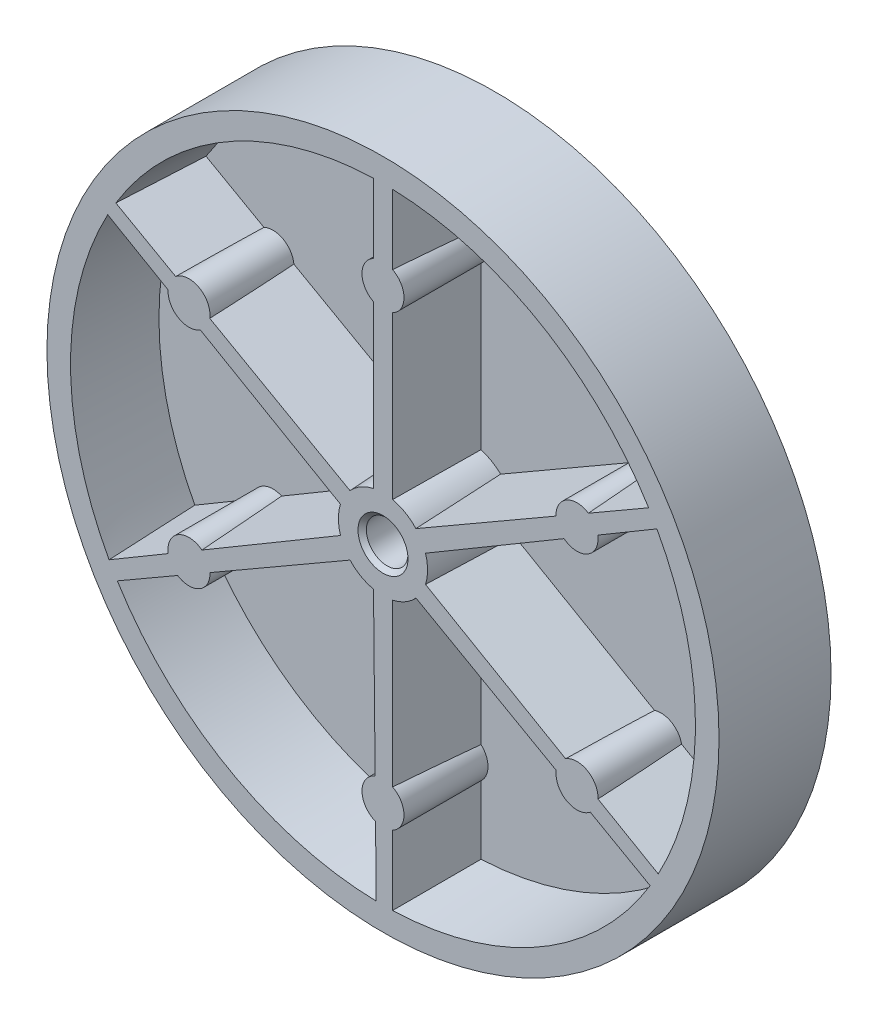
ISO-10303-21;
HEADER;
FILE_DESCRIPTION(('STEP AP214'),'2;1');
FILE_NAME('part.step','',(''),(''),'','','');
FILE_SCHEMA(('AUTOMOTIVE_DESIGN { 1 0 10303 214 1 1 1 1 }'));
ENDSEC;
DATA;
#1=APPLICATION_CONTEXT('core data for automotive mechanical design processes');
#2=APPLICATION_PROTOCOL_DEFINITION('international standard','automotive_design',2000,#1);
#3=PRODUCT_CONTEXT('',#1,'mechanical');
#4=PRODUCT('Part','Part','',(#3));
#5=PRODUCT_RELATED_PRODUCT_CATEGORY('part','',(#4));
#6=PRODUCT_DEFINITION_FORMATION('','',#4);
#7=PRODUCT_DEFINITION_CONTEXT('part definition',#1,'design');
#8=PRODUCT_DEFINITION('design','',#6,#7);
#9=PRODUCT_DEFINITION_SHAPE('','',#8);
#10=(LENGTH_UNIT() NAMED_UNIT(*) SI_UNIT(.MILLI.,.METRE.));
#11=(NAMED_UNIT(*) PLANE_ANGLE_UNIT() SI_UNIT($,.RADIAN.));
#12=(NAMED_UNIT(*) SI_UNIT($,.STERADIAN.) SOLID_ANGLE_UNIT());
#13=UNCERTAINTY_MEASURE_WITH_UNIT(LENGTH_MEASURE(1.E-05),#10,'distance_accuracy_value','');
#14=(GEOMETRIC_REPRESENTATION_CONTEXT(3) GLOBAL_UNCERTAINTY_ASSIGNED_CONTEXT((#13)) GLOBAL_UNIT_ASSIGNED_CONTEXT((#10,
#11,#12)) REPRESENTATION_CONTEXT('',''));
#15=CARTESIAN_POINT('',(0.,0.,0.));
#16=DIRECTION('',(0.,0.,1.));
#17=DIRECTION('',(1.,0.,0.));
#18=AXIS2_PLACEMENT_3D('',#15,#16,#17);
#19=CARTESIAN_POINT('',(0.,0.,1.99999999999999));
#20=DIRECTION('',(0.,0.,0.999999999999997));
#21=DIRECTION('',(1.,0.,0.));
#22=AXIS2_PLACEMENT_3D('',#19,#20,#21);
#23=PLANE('',#22);
#24=DIRECTION('',(-0.866025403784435,0.500000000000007,0.));
#25=VECTOR('',#24,1.);
#26=CARTESIAN_POINT('',(-0.499999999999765,-0.866025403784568,2.));
#27=LINE('',#26,#25);
#28=CARTESIAN_POINT('',(-3.40473750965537,0.811025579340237,2.));
#29=VERTEX_POINT('',#28);
#30=CARTESIAN_POINT('',(-13.3881606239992,6.57495760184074,2.));
#31=VERTEX_POINT('',#30);
#32=EDGE_CURVE('E733',#29,#31,#27,.T.);
#33=ORIENTED_EDGE('',*,*,#32,.T.);
#34=CARTESIAN_POINT('',(-13.8564064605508,8.00000000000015,2.));
#35=DIRECTION('',(0.,0.,0.999999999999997));
#36=DIRECTION('',(1.,0.,0.));
#37=AXIS2_PLACEMENT_3D('',#34,#35,#36);
#38=CIRCLE('',#37,1.5);
#39=CARTESIAN_POINT('',(-15.3246522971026,7.69299159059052,2.));
#40=VERTEX_POINT('',#39);
#41=EDGE_CURVE('E348',#31,#40,#38,.F.);
#42=ORIENTED_EDGE('',*,*,#41,.T.);
#43=CARTESIAN_POINT('',(-19.5328663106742,10.1226050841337,2.00000000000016));
#44=VERTEX_POINT('',#43);
#45=EDGE_CURVE('E356',#40,#44,#27,.T.);
#46=ORIENTED_EDGE('',*,*,#45,.T.);
#47=CARTESIAN_POINT('',(0.,0.,1.99999999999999));
#48=DIRECTION('',(0.,0.,0.999999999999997));
#49=DIRECTION('',(1.,0.,0.));
#50=AXIS2_PLACEMENT_3D('',#47,#48,#49);
#51=CIRCLE('',#50,22.);
#52=CARTESIAN_POINT('',(-19.4402490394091,-10.2993551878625,2.));
#53=VERTEX_POINT('',#52);
#54=EDGE_CURVE('E832',#44,#53,#51,.T.);
#55=ORIENTED_EDGE('',*,*,#54,.T.);
#56=DIRECTION('',(0.860907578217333,0.508761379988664,0.));
#57=VECTOR('',#56,1.);
#58=CARTESIAN_POINT('',(-0.520796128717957,0.881272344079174,2.));
#59=LINE('',#58,#57);
#60=CARTESIAN_POINT('',(-15.3518585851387,-7.88328263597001,2.));
#61=VERTEX_POINT('',#60);
#62=EDGE_CURVE('E761',#53,#61,#59,.T.);
#63=ORIENTED_EDGE('',*,*,#62,.T.);
#64=CARTESIAN_POINT('',(-13.8564064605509,-8.00000000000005,2.));
#65=DIRECTION('',(0.,0.,0.999999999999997));
#66=DIRECTION('',(1.,0.,0.));
#67=AXIS2_PLACEMENT_3D('',#64,#65,#66);
#68=CIRCLE('',#67,1.5);
#69=CARTESIAN_POINT('',(-13.2373580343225,-6.63369877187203,2.));
#70=VERTEX_POINT('',#69);
#71=EDGE_CURVE('E898',#61,#70,#68,.F.);
#72=ORIENTED_EDGE('',*,*,#71,.T.);
#73=CARTESIAN_POINT('',(-3.40221796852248,-0.821530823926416,2.));
#74=VERTEX_POINT('',#73);
#75=EDGE_CURVE('E757',#70,#74,#59,.T.);
#76=ORIENTED_EDGE('',*,*,#75,.T.);
#77=CARTESIAN_POINT('',(0.,0.,1.99999999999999));
#78=DIRECTION('',(0.,0.,0.999999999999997));
#79=DIRECTION('',(1.,0.,0.));
#80=AXIS2_PLACEMENT_3D('',#77,#78,#79);
#81=CIRCLE('',#80,3.5);
#82=EDGE_CURVE('E794',#29,#74,#81,.T.);
#83=ORIENTED_EDGE('',*,*,#82,.F.);
#84=EDGE_LOOP('',(#33,#42,#46,#55,#63,#72,#76,#83));
#85=FACE_BOUND('',#84,.T.);
#86=ADVANCED_FACE('F37',(#85),#23,.T.);
#87=DIRECTION('',(0.871054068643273,-0.491187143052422,0.));
#88=VECTOR('',#87,1.);
#89=CARTESIAN_POINT('',(0.502806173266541,0.891658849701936,2.));
#90=LINE('',#89,#88);
#91=CARTESIAN_POINT('',(-18.6396277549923,11.6860719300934,2.00000000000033));
#92=VERTEX_POINT('',#91);
#93=CARTESIAN_POINT('',(-14.5030523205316,9.35345821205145,2.));
#94=VERTEX_POINT('',#93);
#95=EDGE_CURVE('E440',#92,#94,#90,.T.);
#96=ORIENTED_EDGE('',*,*,#95,.T.);
#97=CARTESIAN_POINT('',(-13.8564064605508,8.00000000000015,2.));
#98=DIRECTION('',(0.,0.,0.999999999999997));
#99=DIRECTION('',(1.,0.,0.));
#100=AXIS2_PLACEMENT_3D('',#97,#98,#99);
#101=CIRCLE('',#100,1.5);
#102=CARTESIAN_POINT('',(-12.3636306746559,8.14703895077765,2.));
#103=VERTEX_POINT('',#102);
#104=EDGE_CURVE('E883',#94,#103,#101,.F.);
#105=ORIENTED_EDGE('',*,*,#104,.T.);
#106=CARTESIAN_POINT('',(-2.41257554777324,2.53564177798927,2.));
#107=VERTEX_POINT('',#106);
#108=EDGE_CURVE('E432',#103,#107,#90,.T.);
#109=ORIENTED_EDGE('',*,*,#108,.T.);
#110=CARTESIAN_POINT('',(-0.999999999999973,3.35410196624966,2.));
#111=VERTEX_POINT('',#110);
#112=EDGE_CURVE('E789',#111,#107,#81,.T.);
#113=ORIENTED_EDGE('',*,*,#112,.F.);
#114=DIRECTION('',(0.,1.,0.));
#115=VECTOR('',#114,1.);
#116=CARTESIAN_POINT('',(-0.999999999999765,0.,1.99999999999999));
#117=LINE('',#116,#115);
#118=CARTESIAN_POINT('',(-0.99999999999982,14.8819660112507,2.));
#119=VERTEX_POINT('',#118);
#120=EDGE_CURVE('E399',#111,#119,#117,.T.);
#121=ORIENTED_EDGE('',*,*,#120,.T.);
#122=CARTESIAN_POINT('',(6.38378239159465E-13,15.9999999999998,2.));
#123=DIRECTION('',(0.,0.,0.999999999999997));
#124=DIRECTION('',(1.,0.,0.));
#125=AXIS2_PLACEMENT_3D('',#122,#123,#124);
#126=CIRCLE('',#125,1.49999999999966);
#127=CARTESIAN_POINT('',(-0.999999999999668,17.1180339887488,2.00000000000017));
#128=VERTEX_POINT('',#127);
#129=EDGE_CURVE('E862',#119,#128,#126,.F.);
#130=ORIENTED_EDGE('',*,*,#129,.T.);
#131=CARTESIAN_POINT('',(-0.999999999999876,21.9772609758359,2.00000000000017));
#132=VERTEX_POINT('',#131);
#133=EDGE_CURVE('E846',#128,#132,#117,.T.);
#134=ORIENTED_EDGE('',*,*,#133,.T.);
#135=EDGE_CURVE('E724',#132,#92,#51,.T.);
#136=ORIENTED_EDGE('',*,*,#135,.T.);
#137=EDGE_LOOP('',(#96,#105,#109,#113,#121,#130,#134,#136));
#138=FACE_BOUND('',#137,.T.);
#139=ADVANCED_FACE('F842',(#138),#23,.T.);
#140=CARTESIAN_POINT('',(0.502806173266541,0.891658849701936,2.));
#141=DIRECTION('',(0.490513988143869,0.869860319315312,0.0523359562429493));
#142=DIRECTION('',(-0.871054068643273,0.491187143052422,0.));
#143=AXIS2_PLACEMENT_3D('',#140,#141,#142);
#144=PLANE('',#143);
#145=CARTESIAN_POINT('',(-13.8564064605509,8.00000000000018,18.4347957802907));
#146=DIRECTION('',(0.490513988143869,0.869860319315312,0.0523359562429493));
#147=DIRECTION('',(0.025706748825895,0.0455874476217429,-0.998629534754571));
#148=AXIS2_PLACEMENT_3D('',#145,#146,#147);
#149=ELLIPSE('',#148,28.6609839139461,1.5);
#150=CARTESIAN_POINT('',(-14.8044473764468,9.16241921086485,7.99999999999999));
#151=VERTEX_POINT('',#150);
#152=EDGE_CURVE('E853',#94,#151,#149,.T.);
#153=ORIENTED_EDGE('',*,*,#152,.F.);
#154=ORIENTED_EDGE('',*,*,#95,.F.);
#155=CARTESIAN_POINT('',(-18.6396277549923,11.6860719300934,2.00000000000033));
#156=CARTESIAN_POINT('',(-18.7131914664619,11.6673898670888,2.99997818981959));
#157=CARTESIAN_POINT('',(-18.7865806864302,11.6486087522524,3.99996728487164));
#158=CARTESIAN_POINT('',(-18.9330101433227,11.6108484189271,5.99996728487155));
#159=CARTESIAN_POINT('',(-19.006050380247,11.5918692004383,6.99997818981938));
#160=CARTESIAN_POINT('',(-19.0789161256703,11.5727909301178,8.));
#161=B_SPLINE_CURVE_WITH_KNOTS('',3,(#155,#156,#157,#158,#159,#160),.UNSPECIFIED.,.F.,.F.,(4,2,
4),(0.,3.00856312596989,6.01712625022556),.UNSPECIFIED.);
#162=CARTESIAN_POINT('',(-19.0789161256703,11.5727909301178,8.));
#163=VERTEX_POINT('',#162);
#164=EDGE_CURVE('E434',#92,#163,#161,.T.);
#165=ORIENTED_EDGE('',*,*,#164,.T.);
#166=DIRECTION('',(0.871054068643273,-0.491187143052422,0.));
#167=VECTOR('',#166,1.);
#168=CARTESIAN_POINT('',(0.348354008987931,0.617758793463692,7.99999999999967));
#169=LINE('',#168,#167);
#170=EDGE_CURVE('E398',#151,#163,#169,.F.);
#171=ORIENTED_EDGE('',*,*,#170,.F.);
#172=EDGE_LOOP('',(#153,#154,#165,#171));
#173=FACE_BOUND('',#172,.T.);
#174=ADVANCED_FACE('F422',(#173),#144,.T.);
#175=CARTESIAN_POINT('',(-12.3711399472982,7.79027783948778,8.));
#176=VERTEX_POINT('',#175);
#177=EDGE_CURVE('E881',#176,#103,#149,.T.);
#178=ORIENTED_EDGE('',*,*,#177,.F.);
#179=CARTESIAN_POINT('',(-2.35679461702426,2.14319133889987,7.99999999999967));
#180=VERTEX_POINT('',#179);
#181=EDGE_CURVE('E368',#180,#176,#169,.F.);
#182=ORIENTED_EDGE('',*,*,#181,.F.);
#183=CARTESIAN_POINT('',(-2.41257554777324,2.53564177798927,2.));
#184=CARTESIAN_POINT('',(-2.40855834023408,2.50329177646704,2.50002881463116));
#185=CARTESIAN_POINT('',(-2.40439491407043,2.47085971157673,3.00005115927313));
#186=CARTESIAN_POINT('',(-2.39575857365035,2.40582191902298,4.00008159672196));
#187=CARTESIAN_POINT('',(-2.39128565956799,2.37321619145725,4.50008968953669));
#188=CARTESIAN_POINT('',(-2.38201328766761,2.30782149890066,5.50009090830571));
#189=CARTESIAN_POINT('',(-2.37721382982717,2.27503253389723,6.00008403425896));
#190=CARTESIAN_POINT('',(-2.3672687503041,2.20926036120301,7.00005434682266));
#191=CARTESIAN_POINT('',(-2.36212312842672,2.17627715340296,7.50003153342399));
#192=CARTESIAN_POINT('',(-2.35679461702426,2.14319133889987,7.99999999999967));
#193=B_SPLINE_CURVE_WITH_KNOTS('',3,(#183,#184,#185,#186,#187,#188,#189,#190,#191,#192),
.UNSPECIFIED.,.F.,.F.,(4,2,2,2,4),(0.,1.50327085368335,3.0065408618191,4.50981097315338,
6.01308193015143),.UNSPECIFIED.);
#194=EDGE_CURVE('E426',#107,#180,#193,.T.);
#195=ORIENTED_EDGE('',*,*,#194,.F.);
#196=ORIENTED_EDGE('',*,*,#108,.F.);
#197=EDGE_LOOP('',(#178,#182,#195,#196));
#198=FACE_BOUND('',#197,.T.);
#199=ADVANCED_FACE('F743',(#198),#144,.T.);
#200=CARTESIAN_POINT('',(-0.499999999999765,-0.866025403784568,2.));
#201=DIRECTION('',(-0.499314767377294,-0.864838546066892,0.0523359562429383));
#202=DIRECTION('',(0.866025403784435,-0.500000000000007,0.));
#203=AXIS2_PLACEMENT_3D('',#200,#201,#202);
#204=PLANE('',#203);
#205=CARTESIAN_POINT('',(-13.8564064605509,8.00000000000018,21.0811366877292));
#206=DIRECTION('',(-0.499314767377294,-0.864838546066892,0.0523359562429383));
#207=DIRECTION('',(-0.0261679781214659,-0.0453242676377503,-0.998629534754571));
#208=AXIS2_PLACEMENT_3D('',#205,#206,#207);
#209=ELLIPSE('',#208,28.6609839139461,1.5);
#210=CARTESIAN_POINT('',(-13.0437557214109,6.7392070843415,8.));
#211=VERTEX_POINT('',#210);
#212=EDGE_CURVE('E346',#31,#211,#209,.T.);
#213=ORIENTED_EDGE('',*,*,#212,.F.);
#214=ORIENTED_EDGE('',*,*,#32,.F.);
#215=CARTESIAN_POINT('',(-3.0369045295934,0.961748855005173,7.99999999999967));
#216=CARTESIAN_POINT('',(-3.06824092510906,0.949585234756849,7.50003220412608));
#217=CARTESIAN_POINT('',(-3.0993934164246,0.93731489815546,7.00005549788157));
#218=CARTESIAN_POINT('',(-3.16135039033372,0.912572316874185,6.00008580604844));
#219=CARTESIAN_POINT('',(-3.1921548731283,0.900100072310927,5.50009282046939));
#220=CARTESIAN_POINT('',(-3.25343566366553,0.874965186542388,4.50009156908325));
#221=CARTESIAN_POINT('',(-3.28391197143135,0.862302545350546,4.00008330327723));
#222=CARTESIAN_POINT('',(-3.34455364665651,0.836796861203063,3.0000522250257));
#223=CARTESIAN_POINT('',(-3.37471901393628,0.823953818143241,2.50002941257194));
#224=CARTESIAN_POINT('',(-3.40473750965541,0.811025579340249,2.));
#225=B_SPLINE_CURVE_WITH_KNOTS('',3,(#215,#216,#217,#218,#219,#220,#221,#222,#223,#224),
.UNSPECIFIED.,.F.,.F.,(4,2,2,2,4),(0.,1.50328947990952,3.00657809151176,4.50986659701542,
6.01315597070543),.UNSPECIFIED.);
#226=CARTESIAN_POINT('',(-3.0369045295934,0.961748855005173,7.99999999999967));
#227=VERTEX_POINT('',#226);
#228=EDGE_CURVE('E363',#227,#29,#225,.T.);
#229=ORIENTED_EDGE('',*,*,#228,.F.);
#230=DIRECTION('',(-0.866025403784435,0.500000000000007,0.));
#231=VECTOR('',#230,1.);
#232=CARTESIAN_POINT('',(-0.342776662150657,-0.593706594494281,7.99999999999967));
#233=LINE('',#232,#231);
#234=EDGE_CURVE('E364',#211,#227,#233,.F.);
#235=ORIENTED_EDGE('',*,*,#234,.F.);
#236=EDGE_LOOP('',(#213,#214,#229,#235));
#237=FACE_BOUND('',#236,.T.);
#238=ADVANCED_FACE('F740',(#237),#204,.T.);
#239=CARTESIAN_POINT('',(-15.3546105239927,8.07337972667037,7.99999999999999));
#240=VERTEX_POINT('',#239);
#241=EDGE_CURVE('E343',#240,#40,#209,.T.);
#242=ORIENTED_EDGE('',*,*,#241,.F.);
#243=CARTESIAN_POINT('',(-19.6585321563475,10.5582500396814,7.99999999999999));
#244=VERTEX_POINT('',#243);
#245=EDGE_CURVE('E354',#244,#240,#233,.F.);
#246=ORIENTED_EDGE('',*,*,#245,.F.);
#247=CARTESIAN_POINT('',(-19.6585321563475,10.5582500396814,7.99999999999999));
#248=CARTESIAN_POINT('',(-19.6379351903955,10.4858417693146,6.99997826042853));
#249=CARTESIAN_POINT('',(-19.6171645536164,10.4133338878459,5.99996739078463));
#250=CARTESIAN_POINT('',(-19.5752759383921,10.2681189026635,3.99996739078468));
#251=CARTESIAN_POINT('',(-19.5541579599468,10.1954117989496,2.99997826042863));
#252=CARTESIAN_POINT('',(-19.5328663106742,10.1226050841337,2.00000000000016));
#253=B_SPLINE_CURVE_WITH_KNOTS('',3,(#247,#248,#249,#250,#251,#252),.UNSPECIFIED.,.F.,.F.,(4,2,
4),(0.,3.00855363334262,6.01710726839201),.UNSPECIFIED.);
#254=EDGE_CURVE('E433',#244,#44,#253,.T.);
#255=ORIENTED_EDGE('',*,*,#254,.T.);
#256=ORIENTED_EDGE('',*,*,#45,.F.);
#257=EDGE_LOOP('',(#242,#246,#255,#256));
#258=FACE_BOUND('',#257,.T.);
#259=ADVANCED_FACE('F352',(#258),#204,.T.);
#260=DIRECTION('',(-0.86602540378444,-0.499999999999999,0.));
#261=VECTOR('',#260,1.);
#262=CARTESIAN_POINT('',(0.500000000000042,-0.866025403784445,2.));
#263=LINE('',#262,#261);
#264=CARTESIAN_POINT('',(-2.40473750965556,-2.54307638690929,2.));
#265=VERTEX_POINT('',#264);
#266=CARTESIAN_POINT('',(-12.388160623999,-8.30700840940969,2.));
#267=VERTEX_POINT('',#266);
#268=EDGE_CURVE('E657',#265,#267,#263,.T.);
#269=ORIENTED_EDGE('',*,*,#268,.T.);
#270=CARTESIAN_POINT('',(-13.8564064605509,-8.00000000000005,2.));
#271=DIRECTION('',(0.,0.,0.999999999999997));
#272=DIRECTION('',(1.,0.,0.));
#273=AXIS2_PLACEMENT_3D('',#270,#271,#272);
#274=CIRCLE('',#273,1.5);
#275=CARTESIAN_POINT('',(-14.3246522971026,-9.42504239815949,1.99999999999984));
#276=VERTEX_POINT('',#275);
#277=EDGE_CURVE('E892',#267,#276,#274,.F.);
#278=ORIENTED_EDGE('',*,*,#277,.T.);
#279=CARTESIAN_POINT('',(-18.5328663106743,-11.8546558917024,1.99999999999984));
#280=VERTEX_POINT('',#279);
#281=EDGE_CURVE('E648',#276,#280,#263,.T.);
#282=ORIENTED_EDGE('',*,*,#281,.T.);
#283=CARTESIAN_POINT('',(-0.80062128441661,-21.9854271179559,1.99999999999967));
#284=VERTEX_POINT('',#283);
#285=EDGE_CURVE('E828',#280,#284,#51,.T.);
#286=ORIENTED_EDGE('',*,*,#285,.T.);
#287=DIRECTION('',(-0.0101464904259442,0.999948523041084,0.));
#288=VECTOR('',#287,1.);
#289=CARTESIAN_POINT('',(-1.02360230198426,-0.010386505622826,1.99999999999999));
#290=LINE('',#289,#288);
#291=CARTESIAN_POINT('',(-0.848806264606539,-17.2367408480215,1.99999999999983));
#292=VERTEX_POINT('',#291);
#293=EDGE_CURVE('E623',#284,#292,#290,.T.);
#294=ORIENTED_EDGE('',*,*,#293,.T.);
#295=CARTESIAN_POINT('',(1.38777878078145E-13,-16.0000000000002,1.99999999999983));
#296=DIRECTION('',(0.,0.,0.999999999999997));
#297=DIRECTION('',(1.,0.,0.));
#298=AXIS2_PLACEMENT_3D('',#295,#296,#297);
#299=CIRCLE('',#298,1.5);
#300=CARTESIAN_POINT('',(-0.87372735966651,-14.7807377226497,1.99999999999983));
#301=VERTEX_POINT('',#300);
#302=EDGE_CURVE('E909',#292,#301,#299,.F.);
#303=ORIENTED_EDGE('',*,*,#302,.T.);
#304=CARTESIAN_POINT('',(-0.98964242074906,-3.35717260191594,2.));
#305=VERTEX_POINT('',#304);
#306=EDGE_CURVE('E775',#301,#305,#290,.T.);
#307=ORIENTED_EDGE('',*,*,#306,.T.);
#308=EDGE_CURVE('E802',#265,#305,#81,.T.);
#309=ORIENTED_EDGE('',*,*,#308,.F.);
#310=EDGE_LOOP('',(#269,#278,#282,#286,#294,#303,#307,#309));
#311=FACE_BOUND('',#310,.T.);
#312=ADVANCED_FACE('F994',(#311),#23,.T.);
#313=CARTESIAN_POINT('',(-0.520796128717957,0.881272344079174,2.));
#314=DIRECTION('',(-0.508064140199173,0.859727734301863,0.0523359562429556));
#315=DIRECTION('',(-0.860907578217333,-0.508761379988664,0.));
#316=AXIS2_PLACEMENT_3D('',#313,#314,#315);
#317=PLANE('',#316);
#318=CARTESIAN_POINT('',(-13.856406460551,-7.99999999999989,18.4347957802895));
#319=DIRECTION('',(-0.508064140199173,0.859727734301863,0.0523359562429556));
#320=DIRECTION('',(-0.0266265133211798,0.0450564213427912,-0.998629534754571));
#321=AXIS2_PLACEMENT_3D('',#318,#319,#320);
#322=ELLIPSE('',#321,28.660983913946,1.5);
#323=CARTESIAN_POINT('',(-15.3371114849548,-8.23981791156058,7.99999999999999));
#324=VERTEX_POINT('',#323);
#325=EDGE_CURVE('E899',#61,#324,#322,.T.);
#326=ORIENTED_EDGE('',*,*,#325,.F.);
#327=ORIENTED_EDGE('',*,*,#62,.F.);
#328=CARTESIAN_POINT('',(-19.4402490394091,-10.2993551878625,2.));
#329=CARTESIAN_POINT('',(-19.4608517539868,-10.372404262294,2.99997818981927));
#330=CARTESIAN_POINT('',(-19.4812814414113,-10.4453517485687,3.99996728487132));
#331=CARTESIAN_POINT('',(-19.5217947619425,-10.5910435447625,5.99996728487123));
#332=CARTESIAN_POINT('',(-19.5418783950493,-10.6637878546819,6.99997818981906));
#333=CARTESIAN_POINT('',(-19.5617890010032,-10.7364305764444,7.99999999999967));
#334=B_SPLINE_CURVE_WITH_KNOTS('',3,(#328,#329,#330,#331,#332,#333),.UNSPECIFIED.,.F.,.F.,(4,2,
4),(0.,3.00856312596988,6.01712625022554),.UNSPECIFIED.);
#335=CARTESIAN_POINT('',(-19.5617890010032,-10.7364305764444,7.99999999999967));
#336=VERTEX_POINT('',#335);
#337=EDGE_CURVE('E371',#53,#336,#334,.T.);
#338=ORIENTED_EDGE('',*,*,#337,.T.);
#339=DIRECTION('',(0.860907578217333,0.508761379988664,0.));
#340=VECTOR('',#339,1.);
#341=CARTESIAN_POINT('',(-0.360817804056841,0.610562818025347,7.99999999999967));
#342=LINE('',#341,#340);
#343=EDGE_CURVE('E386',#324,#336,#342,.F.);
#344=ORIENTED_EDGE('',*,*,#343,.F.);
#345=EDGE_LOOP('',(#326,#327,#338,#344));
#346=FACE_BOUND('',#345,.T.);
#347=ADVANCED_FACE('F750',(#346),#317,.T.);
#348=CARTESIAN_POINT('',(-12.9321484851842,-6.81858254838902,7.99999999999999));
#349=VERTEX_POINT('',#348);
#350=EDGE_CURVE('E896',#349,#70,#322,.T.);
#351=ORIENTED_EDGE('',*,*,#350,.F.);
#352=CARTESIAN_POINT('',(-3.03445545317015,-0.969448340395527,7.99999999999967));
#353=VERTEX_POINT('',#352);
#354=EDGE_CURVE('E382',#353,#349,#342,.F.);
#355=ORIENTED_EDGE('',*,*,#354,.F.);
#356=CARTESIAN_POINT('',(-3.40221796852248,-0.821530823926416,2.));
#357=CARTESIAN_POINT('',(-3.37219344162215,-0.834226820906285,2.50002881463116));
#358=CARTESIAN_POINT('',(-3.34202473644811,-0.84683722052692,3.00005115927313));
#359=CARTESIAN_POINT('',(-3.28138218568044,-0.871876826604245,4.00008159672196));
#360=CARTESIAN_POINT('',(-3.25090834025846,-0.884306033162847,4.50008968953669));
#361=CARTESIAN_POINT('',(-3.18963868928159,-0.90897326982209,5.5000909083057));
#362=CARTESIAN_POINT('',(-3.15884288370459,-0.921211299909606,6.00008403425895));
#363=CARTESIAN_POINT('',(-3.09690997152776,-0.945484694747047,7.00005434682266));
#364=CARTESIAN_POINT('',(-3.06577286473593,-0.957520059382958,7.50003153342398));
#365=CARTESIAN_POINT('',(-3.03445545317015,-0.969448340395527,7.99999999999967));
#366=B_SPLINE_CURVE_WITH_KNOTS('',3,(#356,#357,#358,#359,#360,#361,#362,#363,#364,#365),
.UNSPECIFIED.,.F.,.F.,(4,2,2,2,4),(0.,1.50327085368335,3.0065408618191,4.50981097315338,
6.01308193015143),.UNSPECIFIED.);
#367=EDGE_CURVE('E656',#74,#353,#366,.T.);
#368=ORIENTED_EDGE('',*,*,#367,.F.);
#369=ORIENTED_EDGE('',*,*,#75,.F.);
#370=EDGE_LOOP('',(#351,#355,#368,#369));
#371=FACE_BOUND('',#370,.T.);
#372=ADVANCED_FACE('F1017',(#371),#317,.T.);
#373=CARTESIAN_POINT('',(0.500000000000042,-0.866025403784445,2.));
#374=DIRECTION('',(0.499314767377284,-0.864838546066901,0.0523359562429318));
#375=DIRECTION('',(0.86602540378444,0.499999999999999,0.));
#376=AXIS2_PLACEMENT_3D('',#373,#374,#375);
#377=PLANE('',#376);
#378=CARTESIAN_POINT('',(-13.8564064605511,-7.99999999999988,21.0811366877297));
#379=DIRECTION('',(0.499314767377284,-0.864838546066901,0.0523359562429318));
#380=DIRECTION('',(0.0261679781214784,-0.0453242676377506,-0.998629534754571));
#381=AXIS2_PLACEMENT_3D('',#378,#379,#380);
#382=ELLIPSE('',#381,28.660983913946,1.5);
#383=CARTESIAN_POINT('',(-12.358202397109,-7.92662027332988,7.99999999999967));
#384=VERTEX_POINT('',#383);
#385=EDGE_CURVE('E357',#267,#384,#382,.T.);
#386=ORIENTED_EDGE('',*,*,#385,.F.);
#387=ORIENTED_EDGE('',*,*,#268,.F.);
#388=CARTESIAN_POINT('',(-2.35135120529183,-2.14916204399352,7.99999999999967));
#389=CARTESIAN_POINT('',(-2.35648539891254,-2.18238196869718,7.50003220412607));
#390=CARTESIAN_POINT('',(-2.3614352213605,-2.21549598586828,7.00005549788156));
#391=CARTESIAN_POINT('',(-2.37098600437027,-2.2815235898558,6.00008580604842));
#392=CARTESIAN_POINT('',(-2.37558696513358,-2.31443717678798,5.50009282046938));
#393=CARTESIAN_POINT('',(-2.38445991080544,-2.38007534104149,4.50009156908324));
#394=CARTESIAN_POINT('',(-2.3887318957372,-2.41279991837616,4.00008330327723));
#395=CARTESIAN_POINT('',(-2.39696416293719,-2.47806999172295,3.00005222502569));
#396=CARTESIAN_POINT('',(-2.4009244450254,-2.51061548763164,2.50002941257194));
#397=CARTESIAN_POINT('',(-2.40473750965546,-2.54307638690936,2.));
#398=B_SPLINE_CURVE_WITH_KNOTS('',3,(#388,#389,#390,#391,#392,#393,#394,#395,#396,#397),
.UNSPECIFIED.,.F.,.F.,(4,2,2,2,4),(0.,1.50328947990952,3.00657809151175,4.50986659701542,
6.01315597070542),.UNSPECIFIED.);
#399=CARTESIAN_POINT('',(-2.35135120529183,-2.14916204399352,7.99999999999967));
#400=VERTEX_POINT('',#399);
#401=EDGE_CURVE('E642',#400,#265,#398,.T.);
#402=ORIENTED_EDGE('',*,*,#401,.F.);
#403=DIRECTION('',(-0.86602540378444,-0.499999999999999,0.));
#404=VECTOR('',#403,1.);
#405=CARTESIAN_POINT('',(0.342776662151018,-0.593706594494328,7.99999999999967));
#406=LINE('',#405,#404);
#407=EDGE_CURVE('E385',#384,#400,#406,.F.);
#408=ORIENTED_EDGE('',*,*,#407,.F.);
#409=EDGE_LOOP('',(#386,#387,#402,#408));
#410=FACE_BOUND('',#409,.T.);
#411=ADVANCED_FACE('F39',(#410),#377,.T.);
#412=CARTESIAN_POINT('',(-14.6690571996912,-9.26079291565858,7.99999999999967));
#413=VERTEX_POINT('',#412);
#414=EDGE_CURVE('E680',#413,#276,#382,.T.);
#415=ORIENTED_EDGE('',*,*,#414,.F.);
#416=CARTESIAN_POINT('',(-18.9729788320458,-11.7456632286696,7.99999999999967));
#417=VERTEX_POINT('',#416);
#418=EDGE_CURVE('E649',#417,#413,#406,.F.);
#419=ORIENTED_EDGE('',*,*,#418,.F.);
#420=CARTESIAN_POINT('',(-18.9729788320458,-11.7456632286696,7.99999999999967));
#421=CARTESIAN_POINT('',(-18.8999729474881,-11.7640298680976,6.9999782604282));
#422=CARTESIAN_POINT('',(-18.826793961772,-11.7822959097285,5.9999673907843));
#423=CARTESIAN_POINT('',(-18.6800897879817,-11.8186267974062,3.99996739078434));
#424=CARTESIAN_POINT('',(-18.6065645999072,-11.836691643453,2.9999782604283));
#425=CARTESIAN_POINT('',(-18.5328663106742,-11.8546558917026,1.99999999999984));
#426=B_SPLINE_CURVE_WITH_KNOTS('',3,(#420,#421,#422,#423,#424,#425),.UNSPECIFIED.,.F.,.F.,(4,2,
4),(0.,3.00855363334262,6.01710726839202),.UNSPECIFIED.);
#427=EDGE_CURVE('E650',#417,#280,#426,.T.);
#428=ORIENTED_EDGE('',*,*,#427,.T.);
#429=ORIENTED_EDGE('',*,*,#281,.F.);
#430=EDGE_LOOP('',(#415,#419,#428,#429));
#431=FACE_BOUND('',#430,.T.);
#432=ADVANCED_FACE('F1007',(#431),#377,.T.);
#433=DIRECTION('',(0.,-1.,0.));
#434=VECTOR('',#433,1.);
#435=CARTESIAN_POINT('',(1.00000000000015,0.,1.99999999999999));
#436=LINE('',#435,#434);
#437=CARTESIAN_POINT('',(1.00000000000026,-3.35410196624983,2.));
#438=VERTEX_POINT('',#437);
#439=CARTESIAN_POINT('',(1.00000000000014,-14.8819660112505,1.99999999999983));
#440=VERTEX_POINT('',#439);
#441=EDGE_CURVE('E605',#438,#440,#436,.T.);
#442=ORIENTED_EDGE('',*,*,#441,.T.);
#443=CARTESIAN_POINT('',(1.38777878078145E-13,-16.0000000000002,1.99999999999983));
#444=DIRECTION('',(0.,0.,0.999999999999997));
#445=DIRECTION('',(1.,0.,0.));
#446=AXIS2_PLACEMENT_3D('',#443,#444,#445);
#447=CIRCLE('',#446,1.5);
#448=CARTESIAN_POINT('',(1.00000000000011,-17.1180339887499,1.99999999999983));
#449=VERTEX_POINT('',#448);
#450=EDGE_CURVE('E904',#440,#449,#447,.F.);
#451=ORIENTED_EDGE('',*,*,#450,.T.);
#452=CARTESIAN_POINT('',(1.00000000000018,-21.9772609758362,1.99999999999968));
#453=VERTEX_POINT('',#452);
#454=EDGE_CURVE('E596',#449,#453,#436,.T.);
#455=ORIENTED_EDGE('',*,*,#454,.T.);
#456=CARTESIAN_POINT('',(18.6396277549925,-11.6860719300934,1.99999999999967));
#457=VERTEX_POINT('',#456);
#458=EDGE_CURVE('E824',#453,#457,#51,.T.);
#459=ORIENTED_EDGE('',*,*,#458,.T.);
#460=DIRECTION('',(-0.871054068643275,0.491187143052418,0.));
#461=VECTOR('',#460,1.);
#462=CARTESIAN_POINT('',(-0.502806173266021,-0.891658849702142,2.));
#463=LINE('',#462,#461);
#464=CARTESIAN_POINT('',(14.5030523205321,-9.35345821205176,1.99999999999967));
#465=VERTEX_POINT('',#464);
#466=EDGE_CURVE('E566',#457,#465,#463,.T.);
#467=ORIENTED_EDGE('',*,*,#466,.T.);
#468=CARTESIAN_POINT('',(13.8564064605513,-8.00000000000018,1.99999999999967));
#469=DIRECTION('',(0.,0.,0.999999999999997));
#470=DIRECTION('',(1.,0.,0.));
#471=AXIS2_PLACEMENT_3D('',#468,#469,#470);
#472=CIRCLE('',#471,1.5);
#473=CARTESIAN_POINT('',(12.3636306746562,-8.14703895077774,1.99999999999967));
#474=VERTEX_POINT('',#473);
#475=EDGE_CURVE('E921',#465,#474,#472,.F.);
#476=ORIENTED_EDGE('',*,*,#475,.T.);
#477=CARTESIAN_POINT('',(2.41257554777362,-2.53564177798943,2.));
#478=VERTEX_POINT('',#477);
#479=EDGE_CURVE('E782',#474,#478,#463,.T.);
#480=ORIENTED_EDGE('',*,*,#479,.T.);
#481=EDGE_CURVE('E796',#438,#478,#81,.T.);
#482=ORIENTED_EDGE('',*,*,#481,.F.);
#483=EDGE_LOOP('',(#442,#451,#455,#459,#467,#476,#480,#482));
#484=FACE_BOUND('',#483,.T.);
#485=ADVANCED_FACE('F634',(#484),#23,.T.);
#486=CARTESIAN_POINT('',(-1.02360230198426,-0.010386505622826,1.99999999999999));
#487=DIRECTION('',(-0.998578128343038,-0.0101325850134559,0.0523359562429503));
#488=DIRECTION('',(0.0523386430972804,0.,0.998629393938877));
#489=AXIS2_PLACEMENT_3D('',#486,#487,#488);
#490=PLANE('',#489);
#491=CARTESIAN_POINT('',(-1.11022302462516E-13,-16.,18.4347957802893));
#492=DIRECTION('',(-0.998578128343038,-0.0101325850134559,0.0523359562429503));
#493=DIRECTION('',(-0.0523332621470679,-0.000531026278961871,-0.998629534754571));
#494=AXIS2_PLACEMENT_3D('',#491,#492,#493);
#495=ELLIPSE('',#494,28.660983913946,1.5);
#496=CARTESIAN_POINT('',(-0.532664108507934,-17.4022371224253,7.99999999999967));
#497=VERTEX_POINT('',#496);
#498=EDGE_CURVE('E910',#292,#497,#495,.T.);
#499=ORIENTED_EDGE('',*,*,#498,.F.);
#500=ORIENTED_EDGE('',*,*,#293,.F.);
#501=CARTESIAN_POINT('',(-0.80062128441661,-21.9854271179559,1.99999999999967));
#502=CARTESIAN_POINT('',(-0.747660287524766,-22.0397941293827,2.999978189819));
#503=CARTESIAN_POINT('',(-0.694700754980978,-22.0939605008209,3.99996728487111));
#504=CARTESIAN_POINT('',(-0.588784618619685,-22.2018919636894,5.99996728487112));
#505=CARTESIAN_POINT('',(-0.535828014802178,-22.2556570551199,6.999978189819));
#506=CARTESIAN_POINT('',(-0.482872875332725,-22.3092215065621,7.99999999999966));
#507=B_SPLINE_CURVE_WITH_KNOTS('',3,(#501,#502,#503,#504,#505,#506),.UNSPECIFIED.,.F.,.F.,(4,2,
4),(0.,3.00856312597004,6.01712625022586),.UNSPECIFIED.);
#508=CARTESIAN_POINT('',(-0.482872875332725,-22.3092215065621,7.99999999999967));
#509=VERTEX_POINT('',#508);
#510=EDGE_CURVE('E616',#284,#509,#507,.T.);
#511=ORIENTED_EDGE('',*,*,#510,.T.);
#512=DIRECTION('',(-0.0101464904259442,0.999948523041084,0.));
#513=VECTOR('',#512,1.);
#514=CARTESIAN_POINT('',(-0.709171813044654,-0.00719597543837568,7.99999999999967));
#515=LINE('',#514,#513);
#516=EDGE_CURVE('E661',#497,#509,#515,.F.);
#517=ORIENTED_EDGE('',*,*,#516,.F.);
#518=EDGE_LOOP('',(#499,#500,#511,#517));
#519=FACE_BOUND('',#518,.T.);
#520=ADVANCED_FACE('F630',(#519),#490,.T.);
#521=CARTESIAN_POINT('',(-0.561008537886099,-14.6088603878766,7.99999999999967));
#522=VERTEX_POINT('',#521);
#523=EDGE_CURVE('E907',#522,#301,#495,.T.);
#524=ORIENTED_EDGE('',*,*,#523,.F.);
#525=CARTESIAN_POINT('',(-0.677660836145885,-3.11263967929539,7.99999999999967));
#526=VERTEX_POINT('',#525);
#527=EDGE_CURVE('E658',#526,#522,#515,.F.);
#528=ORIENTED_EDGE('',*,*,#527,.F.);
#529=CARTESIAN_POINT('',(-0.98964242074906,-3.35717260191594,2.));
#530=CARTESIAN_POINT('',(-0.96363510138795,-3.33751859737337,2.50002881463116));
#531=CARTESIAN_POINT('',(-0.937629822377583,-3.31769693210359,3.00005115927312));
#532=CARTESIAN_POINT('',(-0.885623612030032,-3.2776987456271,4.00008159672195));
#533=CARTESIAN_POINT('',(-0.85962268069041,-3.25752222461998,4.50008968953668));
#534=CARTESIAN_POINT('',(-0.807625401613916,-3.21679476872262,5.5000909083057));
#535=CARTESIAN_POINT('',(-0.781629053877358,-3.19624383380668,6.00008403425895));
#536=CARTESIAN_POINT('',(-0.729641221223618,-3.1547450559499,7.00005434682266));
#537=CARTESIAN_POINT('',(-0.703649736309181,-3.1337972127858,7.50003153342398));
#538=CARTESIAN_POINT('',(-0.677660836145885,-3.11263967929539,7.99999999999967));
#539=B_SPLINE_CURVE_WITH_KNOTS('',3,(#529,#530,#531,#532,#533,#534,#535,#536,#537,#538),
.UNSPECIFIED.,.F.,.F.,(4,2,2,2,4),(0.,1.50327085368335,3.00654086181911,4.50981097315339,
6.01308193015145),.UNSPECIFIED.);
#540=EDGE_CURVE('E604',#305,#526,#539,.T.);
#541=ORIENTED_EDGE('',*,*,#540,.F.);
#542=ORIENTED_EDGE('',*,*,#306,.F.);
#543=EDGE_LOOP('',(#524,#528,#541,#542));
#544=FACE_BOUND('',#543,.T.);
#545=ADVANCED_FACE('F633',(#544),#490,.T.);
#546=CARTESIAN_POINT('',(1.00000000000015,0.,1.99999999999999));
#547=DIRECTION('',(0.998629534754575,0.,0.0523359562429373));
#548=DIRECTION('',(0.0523359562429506,0.,-0.998629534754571));
#549=AXIS2_PLACEMENT_3D('',#546,#547,#548);
#550=PLANE('',#549);
#551=CARTESIAN_POINT('',(-1.11022302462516E-13,-16.,21.0811366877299));
#552=DIRECTION('',(0.998629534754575,0.,0.0523359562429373));
#553=DIRECTION('',(0.0523359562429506,0.,-0.998629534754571));
#554=AXIS2_PLACEMENT_3D('',#551,#552,#553);
#555=ELLIPSE('',#554,28.660983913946,1.5);
#556=CARTESIAN_POINT('',(0.685553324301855,-14.6658273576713,7.99999999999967));
#557=VERTEX_POINT('',#556);
#558=EDGE_CURVE('E679',#440,#557,#555,.T.);
#559=ORIENTED_EDGE('',*,*,#558,.F.);
#560=ORIENTED_EDGE('',*,*,#441,.F.);
#561=CARTESIAN_POINT('',(0.685553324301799,-3.1109108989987,7.99999999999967));
#562=CARTESIAN_POINT('',(0.711755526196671,-3.13196720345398,7.50003220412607));
#563=CARTESIAN_POINT('',(0.737958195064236,-3.15281088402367,7.00005549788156));
#564=CARTESIAN_POINT('',(0.790364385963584,-3.19409590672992,6.00008580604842));
#565=CARTESIAN_POINT('',(0.816567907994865,-3.21453724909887,5.50009282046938));
#566=CARTESIAN_POINT('',(0.868975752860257,-3.25504052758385,4.50009156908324));
#567=CARTESIAN_POINT('',(0.895180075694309,-3.27510246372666,4.00008330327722));
#568=CARTESIAN_POINT('',(0.947589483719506,-3.31486685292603,3.00005222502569));
#569=CARTESIAN_POINT('',(0.973794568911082,-3.33456930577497,2.50002941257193));
#570=CARTESIAN_POINT('',(1.00000000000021,-3.35410196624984,2.));
#571=B_SPLINE_CURVE_WITH_KNOTS('',3,(#561,#562,#563,#564,#565,#566,#567,#568,#569,#570),
.UNSPECIFIED.,.F.,.F.,(4,2,2,2,4),(0.,1.50328947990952,3.00657809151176,4.50986659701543,
6.01315597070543),.UNSPECIFIED.);
#572=CARTESIAN_POINT('',(0.685553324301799,-3.1109108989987,7.99999999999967));
#573=VERTEX_POINT('',#572);
#574=EDGE_CURVE('E590',#573,#438,#571,.T.);
#575=ORIENTED_EDGE('',*,*,#574,.F.);
#576=DIRECTION('',(0.,-1.,0.));
#577=VECTOR('',#576,1.);
#578=CARTESIAN_POINT('',(0.685553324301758,0.,7.99999999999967));
#579=LINE('',#578,#577);
#580=EDGE_CURVE('E614',#557,#573,#579,.F.);
#581=ORIENTED_EDGE('',*,*,#580,.F.);
#582=EDGE_LOOP('',(#559,#560,#575,#581));
#583=FACE_BOUND('',#582,.T.);
#584=ADVANCED_FACE('F586',(#583),#550,.T.);
#585=CARTESIAN_POINT('',(0.685553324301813,-17.3341726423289,7.99999999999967));
#586=VERTEX_POINT('',#585);
#587=EDGE_CURVE('E677',#586,#449,#555,.T.);
#588=ORIENTED_EDGE('',*,*,#587,.F.);
#589=CARTESIAN_POINT('',(0.685553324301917,-22.3039132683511,7.99999999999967));
#590=VERTEX_POINT('',#589);
#591=EDGE_CURVE('E597',#590,#586,#579,.F.);
#592=ORIENTED_EDGE('',*,*,#591,.F.);
#593=CARTESIAN_POINT('',(0.685553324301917,-22.3039132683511,7.99999999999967));
#594=CARTESIAN_POINT('',(0.73796224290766,-22.2498716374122,6.99997826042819));
#595=CARTESIAN_POINT('',(0.790370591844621,-22.1956297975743,5.99996739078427));
#596=CARTESIAN_POINT('',(0.89518615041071,-22.0867457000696,3.99996739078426));
#597=CARTESIAN_POINT('',(0.947593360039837,-22.0321034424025,2.99997826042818));
#598=CARTESIAN_POINT('',(1.00000000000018,-21.9772609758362,1.99999999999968));
#599=B_SPLINE_CURVE_WITH_KNOTS('',3,(#593,#594,#595,#596,#597,#598),.UNSPECIFIED.,.F.,.F.,(4,2,
4),(0.,3.00855363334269,6.01710726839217),.UNSPECIFIED.);
#600=EDGE_CURVE('E598',#590,#453,#599,.T.);
#601=ORIENTED_EDGE('',*,*,#600,.T.);
#602=ORIENTED_EDGE('',*,*,#454,.F.);
#603=EDGE_LOOP('',(#588,#592,#601,#602));
#604=FACE_BOUND('',#603,.T.);
#605=ADVANCED_FACE('F968',(#604),#550,.T.);
#606=DIRECTION('',(0.866025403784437,-0.500000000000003,0.));
#607=VECTOR('',#606,1.);
#608=CARTESIAN_POINT('',(0.50000000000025,0.866025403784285,2.));
#609=LINE('',#608,#607);
#610=CARTESIAN_POINT('',(3.4047375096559,-0.811025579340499,2.));
#611=VERTEX_POINT('',#610);
#612=CARTESIAN_POINT('',(13.3881606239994,-6.57495760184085,1.99999999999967));
#613=VERTEX_POINT('',#612);
#614=EDGE_CURVE('E776',#611,#613,#609,.T.);
#615=ORIENTED_EDGE('',*,*,#614,.T.);
#616=CARTESIAN_POINT('',(13.8564064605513,-8.00000000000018,1.99999999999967));
#617=DIRECTION('',(0.,0.,0.999999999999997));
#618=DIRECTION('',(1.,0.,0.));
#619=AXIS2_PLACEMENT_3D('',#616,#617,#618);
#620=CIRCLE('',#619,1.5);
#621=CARTESIAN_POINT('',(15.324652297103,-7.69299159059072,1.99999999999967));
#622=VERTEX_POINT('',#621);
#623=EDGE_CURVE('E916',#613,#622,#620,.F.);
#624=ORIENTED_EDGE('',*,*,#623,.T.);
#625=CARTESIAN_POINT('',(19.5328663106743,-10.1226050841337,1.99999999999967));
#626=VERTEX_POINT('',#625);
#627=EDGE_CURVE('E779',#622,#626,#609,.T.);
#628=ORIENTED_EDGE('',*,*,#627,.T.);
#629=CARTESIAN_POINT('',(19.4402490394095,10.2993551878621,1.99999999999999));
#630=VERTEX_POINT('',#629);
#631=EDGE_CURVE('E726',#626,#630,#51,.T.);
#632=ORIENTED_EDGE('',*,*,#631,.T.);
#633=DIRECTION('',(-0.860907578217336,-0.508761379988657,0.));
#634=VECTOR('',#633,1.);
#635=CARTESIAN_POINT('',(0.520796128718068,-0.881272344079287,2.));
#636=LINE('',#635,#634);
#637=CARTESIAN_POINT('',(15.3518585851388,7.88328263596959,1.99999999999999));
#638=VERTEX_POINT('',#637);
#639=EDGE_CURVE('E520',#630,#638,#636,.T.);
#640=ORIENTED_EDGE('',*,*,#639,.T.);
#641=CARTESIAN_POINT('',(13.8564064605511,7.99999999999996,1.99999999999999));
#642=DIRECTION('',(0.,0.,0.999999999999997));
#643=DIRECTION('',(1.,0.,0.));
#644=AXIS2_PLACEMENT_3D('',#641,#642,#643);
#645=CIRCLE('',#644,1.5);
#646=CARTESIAN_POINT('',(13.237358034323,6.6336987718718,1.99999999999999));
#647=VERTEX_POINT('',#646);
#648=EDGE_CURVE('E933',#638,#647,#645,.F.);
#649=ORIENTED_EDGE('',*,*,#648,.T.);
#650=CARTESIAN_POINT('',(3.40221796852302,0.821530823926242,1.99999999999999));
#651=VERTEX_POINT('',#650);
#652=EDGE_CURVE('E542',#647,#651,#636,.T.);
#653=ORIENTED_EDGE('',*,*,#652,.T.);
#654=EDGE_CURVE('E790',#611,#651,#81,.T.);
#655=ORIENTED_EDGE('',*,*,#654,.F.);
#656=EDGE_LOOP('',(#615,#624,#628,#632,#640,#649,#653,#655));
#657=FACE_BOUND('',#656,.T.);
#658=ADVANCED_FACE('F579',(#657),#23,.T.);
#659=CARTESIAN_POINT('',(-0.502806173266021,-0.891658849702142,2.));
#660=DIRECTION('',(-0.490513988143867,-0.869860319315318,0.0523359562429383));
#661=DIRECTION('',(0.871054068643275,-0.491187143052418,0.));
#662=AXIS2_PLACEMENT_3D('',#659,#660,#661);
#663=PLANE('',#662);
#664=CARTESIAN_POINT('',(13.856406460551,-8.00000000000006,18.4347957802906));
#665=DIRECTION('',(-0.490513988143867,-0.869860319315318,0.0523359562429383));
#666=DIRECTION('',(-0.0257067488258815,-0.045587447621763,-0.998629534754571));
#667=AXIS2_PLACEMENT_3D('',#664,#665,#666);
#668=ELLIPSE('',#667,28.660983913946,1.5);
#669=CARTESIAN_POINT('',(14.8044473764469,-9.16241921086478,7.99999999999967));
#670=VERTEX_POINT('',#669);
#671=EDGE_CURVE('E922',#465,#670,#668,.T.);
#672=ORIENTED_EDGE('',*,*,#671,.F.);
#673=ORIENTED_EDGE('',*,*,#466,.F.);
#674=CARTESIAN_POINT('',(18.6396277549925,-11.6860719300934,1.99999999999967));
#675=CARTESIAN_POINT('',(18.713191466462,-11.6673898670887,2.99997818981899));
#676=CARTESIAN_POINT('',(18.7865806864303,-11.6486087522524,3.9999672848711));
#677=CARTESIAN_POINT('',(18.9330101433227,-11.610848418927,5.99996728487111));
#678=CARTESIAN_POINT('',(19.0060503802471,-11.5918692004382,6.99997818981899));
#679=CARTESIAN_POINT('',(19.0789161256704,-11.5727909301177,7.99999999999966));
#680=B_SPLINE_CURVE_WITH_KNOTS('',3,(#674,#675,#676,#677,#678,#679),.UNSPECIFIED.,.F.,.F.,(4,2,
4),(0.,3.00856312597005,6.01712625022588),.UNSPECIFIED.);
#681=CARTESIAN_POINT('',(19.0789161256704,-11.5727909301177,7.99999999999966));
#682=VERTEX_POINT('',#681);
#683=EDGE_CURVE('E559',#457,#682,#680,.T.);
#684=ORIENTED_EDGE('',*,*,#683,.T.);
#685=DIRECTION('',(-0.871054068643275,0.491187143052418,0.));
#686=VECTOR('',#685,1.);
#687=CARTESIAN_POINT('',(-0.348354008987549,-0.61775879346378,7.99999999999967));
#688=LINE('',#687,#686);
#689=EDGE_CURVE('E609',#670,#682,#688,.F.);
#690=ORIENTED_EDGE('',*,*,#689,.F.);
#691=EDGE_LOOP('',(#672,#673,#684,#690));
#692=FACE_BOUND('',#691,.T.);
#693=ADVANCED_FACE('F575',(#692),#663,.T.);
#694=CARTESIAN_POINT('',(12.3711399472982,-7.79027783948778,7.99999999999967));
#695=VERTEX_POINT('',#694);
#696=EDGE_CURVE('E919',#695,#474,#668,.T.);
#697=ORIENTED_EDGE('',*,*,#696,.F.);
#698=CARTESIAN_POINT('',(2.35679461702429,-2.14319133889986,7.99999999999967));
#699=VERTEX_POINT('',#698);
#700=EDGE_CURVE('E606',#699,#695,#688,.F.);
#701=ORIENTED_EDGE('',*,*,#700,.F.);
#702=CARTESIAN_POINT('',(2.41257554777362,-2.53564177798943,2.));
#703=CARTESIAN_POINT('',(2.40855834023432,-2.5032917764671,2.50002881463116));
#704=CARTESIAN_POINT('',(2.40439491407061,-2.47085971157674,3.00005115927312));
#705=CARTESIAN_POINT('',(2.39575857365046,-2.40582191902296,4.00008159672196));
#706=CARTESIAN_POINT('',(2.3912856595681,-2.37321619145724,4.50008968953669));
#707=CARTESIAN_POINT('',(2.3820132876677,-2.30782149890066,5.5000909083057));
#708=CARTESIAN_POINT('',(2.37721382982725,-2.27503253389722,6.00008403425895));
#709=CARTESIAN_POINT('',(2.36726875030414,-2.209260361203,7.00005434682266));
#710=CARTESIAN_POINT('',(2.36212312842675,-2.17627715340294,7.50003153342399));
#711=CARTESIAN_POINT('',(2.35679461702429,-2.14319133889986,7.99999999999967));
#712=B_SPLINE_CURVE_WITH_KNOTS('',3,(#702,#703,#704,#705,#706,#707,#708,#709,#710,#711),
.UNSPECIFIED.,.F.,.F.,(4,2,2,2,4),(0.,1.50327085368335,3.00654086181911,4.50981097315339,
6.01308193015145),.UNSPECIFIED.);
#713=EDGE_CURVE('E567',#478,#699,#712,.T.);
#714=ORIENTED_EDGE('',*,*,#713,.F.);
#715=ORIENTED_EDGE('',*,*,#479,.F.);
#716=EDGE_LOOP('',(#697,#701,#714,#715));
#717=FACE_BOUND('',#716,.T.);
#718=ADVANCED_FACE('F578',(#717),#663,.T.);
#719=CARTESIAN_POINT('',(0.50000000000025,0.866025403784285,2.));
#720=DIRECTION('',(0.499314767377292,0.8648385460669,0.0523359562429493));
#721=DIRECTION('',(-0.866025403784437,0.500000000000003,0.));
#722=AXIS2_PLACEMENT_3D('',#719,#720,#721);
#723=PLANE('',#722);
#724=CARTESIAN_POINT('',(13.8564064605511,-8.00000000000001,21.081136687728));
#725=DIRECTION('',(0.499314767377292,0.8648385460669,0.0523359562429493));
#726=DIRECTION('',(0.0261679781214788,0.0453242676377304,-0.998629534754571));
#727=AXIS2_PLACEMENT_3D('',#724,#725,#726);
#728=ELLIPSE('',#727,28.660983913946,1.5);
#729=CARTESIAN_POINT('',(13.043755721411,-6.73920708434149,7.99999999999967));
#730=VERTEX_POINT('',#729);
#731=EDGE_CURVE('E676',#613,#730,#728,.T.);
#732=ORIENTED_EDGE('',*,*,#731,.F.);
#733=ORIENTED_EDGE('',*,*,#614,.F.);
#734=CARTESIAN_POINT('',(3.03690452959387,-0.961748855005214,7.99999999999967));
#735=CARTESIAN_POINT('',(3.06824092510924,-0.949585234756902,7.50003220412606));
#736=CARTESIAN_POINT('',(3.09939341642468,-0.937314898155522,7.00005549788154));
#737=CARTESIAN_POINT('',(3.16135039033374,-0.912572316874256,6.00008580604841));
#738=CARTESIAN_POINT('',(3.19215487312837,-0.900100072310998,5.50009282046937));
#739=CARTESIAN_POINT('',(3.25343566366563,-0.874965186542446,4.50009156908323));
#740=CARTESIAN_POINT('',(3.28391197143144,-0.862302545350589,4.00008330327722));
#741=CARTESIAN_POINT('',(3.34455364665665,-0.836796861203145,3.00005222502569));
#742=CARTESIAN_POINT('',(3.37471901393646,-0.823953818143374,2.50002941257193));
#743=CARTESIAN_POINT('',(3.40473750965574,-0.811025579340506,2.));
#744=B_SPLINE_CURVE_WITH_KNOTS('',3,(#734,#735,#736,#737,#738,#739,#740,#741,#742,#743),
.UNSPECIFIED.,.F.,.F.,(4,2,2,2,4),(0.,1.50328947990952,3.00657809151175,4.50986659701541,
6.01315597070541),.UNSPECIFIED.);
#745=CARTESIAN_POINT('',(3.03690452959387,-0.961748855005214,7.99999999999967));
#746=VERTEX_POINT('',#745);
#747=EDGE_CURVE('E521',#746,#611,#744,.T.);
#748=ORIENTED_EDGE('',*,*,#747,.F.);
#749=DIRECTION('',(0.866025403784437,-0.500000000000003,0.));
#750=VECTOR('',#749,1.);
#751=CARTESIAN_POINT('',(0.342776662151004,0.593706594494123,7.99999999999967));
#752=LINE('',#751,#750);
#753=EDGE_CURVE('E551',#730,#746,#752,.F.);
#754=ORIENTED_EDGE('',*,*,#753,.F.);
#755=EDGE_LOOP('',(#732,#733,#748,#754));
#756=FACE_BOUND('',#755,.T.);
#757=ADVANCED_FACE('F502',(#756),#723,.T.);
#758=CARTESIAN_POINT('',(15.354610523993,-8.07337972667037,7.99999999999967));
#759=VERTEX_POINT('',#758);
#760=EDGE_CURVE('E674',#759,#622,#728,.T.);
#761=ORIENTED_EDGE('',*,*,#760,.F.);
#762=CARTESIAN_POINT('',(19.6585321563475,-10.5582500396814,7.99999999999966));
#763=VERTEX_POINT('',#762);
#764=EDGE_CURVE('E548',#763,#759,#752,.F.);
#765=ORIENTED_EDGE('',*,*,#764,.F.);
#766=CARTESIAN_POINT('',(19.6585321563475,-10.5582500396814,7.99999999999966));
#767=CARTESIAN_POINT('',(19.6379351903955,-10.4858417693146,6.99997826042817));
#768=CARTESIAN_POINT('',(19.6171645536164,-10.4133338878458,5.99996739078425));
#769=CARTESIAN_POINT('',(19.5752759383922,-10.2681189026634,3.99996739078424));
#770=CARTESIAN_POINT('',(19.5541579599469,-10.1954117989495,2.99997826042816));
#771=CARTESIAN_POINT('',(19.5328663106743,-10.1226050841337,1.99999999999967));
#772=B_SPLINE_CURVE_WITH_KNOTS('',3,(#766,#767,#768,#769,#770,#771),.UNSPECIFIED.,.F.,.F.,(4,2,
4),(0.,3.00855363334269,6.01710726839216),.UNSPECIFIED.);
#773=EDGE_CURVE('E507',#763,#626,#772,.T.);
#774=ORIENTED_EDGE('',*,*,#773,.T.);
#775=ORIENTED_EDGE('',*,*,#627,.F.);
#776=EDGE_LOOP('',(#761,#765,#774,#775));
#777=FACE_BOUND('',#776,.T.);
#778=ADVANCED_FACE('F997',(#777),#723,.T.);
#779=DIRECTION('',(0.866025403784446,0.499999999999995,0.));
#780=VECTOR('',#779,1.);
#781=CARTESIAN_POINT('',(-0.499999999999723,0.866025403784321,2.));
#782=LINE('',#781,#780);
#783=CARTESIAN_POINT('',(2.40473750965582,2.54307638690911,2.));
#784=VERTEX_POINT('',#783);
#785=CARTESIAN_POINT('',(12.3881606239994,8.30700840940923,1.99999999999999));
#786=VERTEX_POINT('',#785);
#787=EDGE_CURVE('E783',#784,#786,#782,.T.);
#788=ORIENTED_EDGE('',*,*,#787,.T.);
#789=CARTESIAN_POINT('',(13.8564064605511,7.99999999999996,1.99999999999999));
#790=DIRECTION('',(0.,0.,0.999999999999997));
#791=DIRECTION('',(1.,0.,0.));
#792=AXIS2_PLACEMENT_3D('',#789,#790,#791);
#793=CIRCLE('',#792,1.5);
#794=CARTESIAN_POINT('',(14.3246522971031,9.4250423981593,1.99999999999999));
#795=VERTEX_POINT('',#794);
#796=EDGE_CURVE('E928',#786,#795,#793,.F.);
#797=ORIENTED_EDGE('',*,*,#796,.T.);
#798=CARTESIAN_POINT('',(18.5328663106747,11.8546558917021,1.99999999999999));
#799=VERTEX_POINT('',#798);
#800=EDGE_CURVE('E786',#795,#799,#782,.T.);
#801=ORIENTED_EDGE('',*,*,#800,.T.);
#802=CARTESIAN_POINT('',(1.00000000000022,21.9772609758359,2.00000000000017));
#803=VERTEX_POINT('',#802);
#804=EDGE_CURVE('E719',#799,#803,#51,.T.);
#805=ORIENTED_EDGE('',*,*,#804,.T.);
#806=DIRECTION('',(0.,-1.,0.));
#807=VECTOR('',#806,1.);
#808=CARTESIAN_POINT('',(1.00000000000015,0.,1.99999999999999));
#809=LINE('',#808,#807);
#810=CARTESIAN_POINT('',(1.00000000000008,17.1180339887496,2.));
#811=VERTEX_POINT('',#810);
#812=EDGE_CURVE('E459',#803,#811,#809,.T.);
#813=ORIENTED_EDGE('',*,*,#812,.T.);
#814=CARTESIAN_POINT('',(6.38378239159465E-13,15.9999999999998,2.));
#815=DIRECTION('',(0.,0.,0.999999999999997));
#816=DIRECTION('',(1.,0.,0.));
#817=AXIS2_PLACEMENT_3D('',#814,#815,#816);
#818=CIRCLE('',#817,1.49999999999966);
#819=CARTESIAN_POINT('',(1.00000000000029,14.8819660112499,2.));
#820=VERTEX_POINT('',#819);
#821=EDGE_CURVE('E863',#811,#820,#818,.F.);
#822=ORIENTED_EDGE('',*,*,#821,.T.);
#823=CARTESIAN_POINT('',(1.00000000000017,3.35410196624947,2.));
#824=VERTEX_POINT('',#823);
#825=EDGE_CURVE('E482',#820,#824,#809,.T.);
#826=ORIENTED_EDGE('',*,*,#825,.T.);
#827=EDGE_CURVE('E547',#784,#824,#81,.T.);
#828=ORIENTED_EDGE('',*,*,#827,.F.);
#829=EDGE_LOOP('',(#788,#797,#801,#805,#813,#822,#826,#828));
#830=FACE_BOUND('',#829,.T.);
#831=ADVANCED_FACE('F531',(#830),#23,.T.);
#832=CARTESIAN_POINT('',(0.520796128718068,-0.881272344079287,2.));
#833=DIRECTION('',(0.508064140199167,-0.859727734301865,0.052335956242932));
#834=DIRECTION('',(0.860907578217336,0.508761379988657,0.));
#835=AXIS2_PLACEMENT_3D('',#832,#833,#834);
#836=PLANE('',#835);
#837=CARTESIAN_POINT('',(13.856406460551,7.99999999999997,18.4347957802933));
#838=DIRECTION('',(0.508064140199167,-0.859727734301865,0.052335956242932));
#839=DIRECTION('',(0.0266265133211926,-0.0450564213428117,-0.998629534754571));
#840=AXIS2_PLACEMENT_3D('',#837,#838,#839);
#841=ELLIPSE('',#840,28.660983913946,1.5);
#842=CARTESIAN_POINT('',(15.3371114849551,8.23981791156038,7.99999999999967));
#843=VERTEX_POINT('',#842);
#844=EDGE_CURVE('E934',#638,#843,#841,.T.);
#845=ORIENTED_EDGE('',*,*,#844,.F.);
#846=ORIENTED_EDGE('',*,*,#639,.F.);
#847=CARTESIAN_POINT('',(19.4402490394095,10.2993551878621,1.99999999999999));
#848=CARTESIAN_POINT('',(19.4608517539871,10.3724042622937,2.99997818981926));
#849=CARTESIAN_POINT('',(19.4812814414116,10.4453517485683,3.99996728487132));
#850=CARTESIAN_POINT('',(19.5217947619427,10.5910435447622,5.99996728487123));
#851=CARTESIAN_POINT('',(19.5418783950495,10.6637878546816,6.99997818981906));
#852=CARTESIAN_POINT('',(19.5617890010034,10.7364305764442,7.99999999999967));
#853=B_SPLINE_CURVE_WITH_KNOTS('',3,(#847,#848,#849,#850,#851,#852),.UNSPECIFIED.,.F.,.F.,(4,2,
4),(0.,3.00856312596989,6.01712625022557),.UNSPECIFIED.);
#854=CARTESIAN_POINT('',(19.5617890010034,10.7364305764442,7.99999999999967));
#855=VERTEX_POINT('',#854);
#856=EDGE_CURVE('E513',#630,#855,#853,.T.);
#857=ORIENTED_EDGE('',*,*,#856,.T.);
#858=DIRECTION('',(-0.860907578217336,-0.508761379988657,0.));
#859=VECTOR('',#858,1.);
#860=CARTESIAN_POINT('',(0.360817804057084,-0.610562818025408,7.99999999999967));
#861=LINE('',#860,#859);
#862=EDGE_CURVE('E558',#843,#855,#861,.F.);
#863=ORIENTED_EDGE('',*,*,#862,.F.);
#864=EDGE_LOOP('',(#845,#846,#857,#863));
#865=FACE_BOUND('',#864,.T.);
#866=ADVANCED_FACE('F527',(#865),#836,.T.);
#867=CARTESIAN_POINT('',(12.9321484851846,6.81858254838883,7.99999999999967));
#868=VERTEX_POINT('',#867);
#869=EDGE_CURVE('E931',#868,#647,#841,.T.);
#870=ORIENTED_EDGE('',*,*,#869,.F.);
#871=CARTESIAN_POINT('',(3.03445545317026,0.969448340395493,7.99999999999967));
#872=VERTEX_POINT('',#871);
#873=EDGE_CURVE('E554',#872,#868,#861,.F.);
#874=ORIENTED_EDGE('',*,*,#873,.F.);
#875=CARTESIAN_POINT('',(3.40221796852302,0.821530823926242,1.99999999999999));
#876=CARTESIAN_POINT('',(3.37219344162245,0.834226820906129,2.50002881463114));
#877=CARTESIAN_POINT('',(3.34202473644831,0.846837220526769,3.00005115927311));
#878=CARTESIAN_POINT('',(3.28138218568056,0.871876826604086,4.00008159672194));
#879=CARTESIAN_POINT('',(3.25090834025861,0.884306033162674,4.50008968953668));
#880=CARTESIAN_POINT('',(3.18963868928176,0.908973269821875,5.50009090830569));
#881=CARTESIAN_POINT('',(3.15884288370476,0.921211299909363,6.00008403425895));
#882=CARTESIAN_POINT('',(3.09690997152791,0.945484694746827,7.00005434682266));
#883=CARTESIAN_POINT('',(3.06577286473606,0.957520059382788,7.50003153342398));
#884=CARTESIAN_POINT('',(3.03445545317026,0.969448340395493,7.99999999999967));
#885=B_SPLINE_CURVE_WITH_KNOTS('',3,(#875,#876,#877,#878,#879,#880,#881,#882,#883,#884),
.UNSPECIFIED.,.F.,.F.,(4,2,2,2,4),(0.,1.50327085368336,3.00654086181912,4.50981097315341,
6.01308193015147),.UNSPECIFIED.);
#886=EDGE_CURVE('E536',#651,#872,#885,.T.);
#887=ORIENTED_EDGE('',*,*,#886,.F.);
#888=ORIENTED_EDGE('',*,*,#652,.F.);
#889=EDGE_LOOP('',(#870,#874,#887,#888));
#890=FACE_BOUND('',#889,.T.);
#891=ADVANCED_FACE('F530',(#890),#836,.T.);
#892=CARTESIAN_POINT('',(-0.499999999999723,0.866025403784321,2.));
#893=DIRECTION('',(-0.499314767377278,0.864838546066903,0.0523359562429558));
#894=DIRECTION('',(-0.866025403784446,-0.499999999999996,0.));
#895=AXIS2_PLACEMENT_3D('',#892,#893,#894);
#896=PLANE('',#895);
#897=CARTESIAN_POINT('',(13.856406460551,7.99999999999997,21.0811366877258));
#898=DIRECTION('',(-0.499314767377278,0.864838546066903,0.0523359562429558));
#899=DIRECTION('',(-0.0261679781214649,0.0453242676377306,-0.998629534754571));
#900=AXIS2_PLACEMENT_3D('',#897,#898,#899);
#901=ELLIPSE('',#900,28.660983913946,1.5);
#902=CARTESIAN_POINT('',(12.3582023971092,7.92662027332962,7.99999999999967));
#903=VERTEX_POINT('',#902);
#904=EDGE_CURVE('E673',#786,#903,#901,.T.);
#905=ORIENTED_EDGE('',*,*,#904,.F.);
#906=ORIENTED_EDGE('',*,*,#787,.F.);
#907=CARTESIAN_POINT('',(2.3513512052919,2.1491620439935,7.99999999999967));
#908=CARTESIAN_POINT('',(2.3564853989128,2.18238196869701,7.50003220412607));
#909=CARTESIAN_POINT('',(2.36143522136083,2.21549598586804,7.00005549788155));
#910=CARTESIAN_POINT('',(2.37098600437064,2.28152358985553,6.00008580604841));
#911=CARTESIAN_POINT('',(2.37558696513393,2.31443717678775,5.50009282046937));
#912=CARTESIAN_POINT('',(2.38445991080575,2.38007534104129,4.50009156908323));
#913=CARTESIAN_POINT('',(2.3887318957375,2.41279991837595,4.00008330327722));
#914=CARTESIAN_POINT('',(2.39696416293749,2.47806999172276,3.00005222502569));
#915=CARTESIAN_POINT('',(2.40092444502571,2.51061548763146,2.50002941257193));
#916=CARTESIAN_POINT('',(2.40473750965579,2.5430763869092,2.));
#917=B_SPLINE_CURVE_WITH_KNOTS('',3,(#907,#908,#909,#910,#911,#912,#913,#914,#915,#916),
.UNSPECIFIED.,.F.,.F.,(4,2,2,2,4),(0.,1.50328947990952,3.00657809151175,4.50986659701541,
6.01315597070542),.UNSPECIFIED.);
#918=CARTESIAN_POINT('',(2.3513512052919,2.1491620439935,7.99999999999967));
#919=VERTEX_POINT('',#918);
#920=EDGE_CURVE('E484',#919,#784,#917,.T.);
#921=ORIENTED_EDGE('',*,*,#920,.F.);
#922=DIRECTION('',(0.866025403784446,0.499999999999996,0.));
#923=VECTOR('',#922,1.);
#924=CARTESIAN_POINT('',(-0.342776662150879,0.593706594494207,7.99999999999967));
#925=LINE('',#924,#923);
#926=EDGE_CURVE('E557',#903,#919,#925,.F.);
#927=ORIENTED_EDGE('',*,*,#926,.F.);
#928=EDGE_LOOP('',(#905,#906,#921,#927));
#929=FACE_BOUND('',#928,.T.);
#930=ADVANCED_FACE('F472',(#929),#896,.T.);
#931=CARTESIAN_POINT('',(14.6690571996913,9.26079291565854,7.99999999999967));
#932=VERTEX_POINT('',#931);
#933=EDGE_CURVE('E671',#932,#795,#901,.T.);
#934=ORIENTED_EDGE('',*,*,#933,.F.);
#935=CARTESIAN_POINT('',(18.9729788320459,11.7456632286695,7.99999999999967));
#936=VERTEX_POINT('',#935);
#937=EDGE_CURVE('E809',#936,#932,#925,.F.);
#938=ORIENTED_EDGE('',*,*,#937,.F.);
#939=CARTESIAN_POINT('',(18.9729788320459,11.7456632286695,7.99999999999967));
#940=CARTESIAN_POINT('',(18.8999729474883,11.7640298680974,6.99997826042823));
#941=CARTESIAN_POINT('',(18.8267939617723,11.7822959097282,5.99996739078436));
#942=CARTESIAN_POINT('',(18.6800897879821,11.8186267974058,3.99996739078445));
#943=CARTESIAN_POINT('',(18.6065645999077,11.8366916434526,2.99997826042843));
#944=CARTESIAN_POINT('',(18.5328663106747,11.8546558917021,1.99999999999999));
#945=B_SPLINE_CURVE_WITH_KNOTS('',3,(#939,#940,#941,#942,#943,#944),.UNSPECIFIED.,.F.,.F.,(4,2,
4),(0.,3.00855363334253,6.01710726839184),.UNSPECIFIED.);
#946=EDGE_CURVE('E460',#936,#799,#945,.T.);
#947=ORIENTED_EDGE('',*,*,#946,.T.);
#948=ORIENTED_EDGE('',*,*,#800,.F.);
#949=EDGE_LOOP('',(#934,#938,#947,#948));
#950=FACE_BOUND('',#949,.T.);
#951=ADVANCED_FACE('F412',(#950),#896,.T.);
#952=CARTESIAN_POINT('',(-0.999999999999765,0.,1.99999999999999));
#953=DIRECTION('',(-0.998629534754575,0.,0.0523359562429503));
#954=DIRECTION('',(0.0523359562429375,0.,0.998629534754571));
#955=AXIS2_PLACEMENT_3D('',#952,#953,#954);
#956=PLANE('',#955);
#957=CARTESIAN_POINT('',(4.57966997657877E-13,15.9999999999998,21.0811366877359));
#958=DIRECTION('',(-0.998629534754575,0.,0.0523359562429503));
#959=DIRECTION('',(-0.0523359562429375,0.,-0.998629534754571));
#960=AXIS2_PLACEMENT_3D('',#957,#958,#959);
#961=ELLIPSE('',#960,28.6609839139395,1.49999999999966);
#962=CARTESIAN_POINT('',(-0.685553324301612,14.6658273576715,7.99999999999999));
#963=VERTEX_POINT('',#962);
#964=EDGE_CURVE('E865',#119,#963,#961,.T.);
#965=ORIENTED_EDGE('',*,*,#964,.F.);
#966=ORIENTED_EDGE('',*,*,#120,.F.);
#967=CARTESIAN_POINT('',(-0.685553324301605,3.11091089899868,7.99999999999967));
#968=CARTESIAN_POINT('',(-0.711755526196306,3.13196720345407,7.50003220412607));
#969=CARTESIAN_POINT('',(-0.737958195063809,3.15281088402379,7.00005549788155));
#970=CARTESIAN_POINT('',(-0.790364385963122,3.19409590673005,6.00008580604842));
#971=CARTESIAN_POINT('',(-0.816567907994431,3.21453724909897,5.50009282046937));
#972=CARTESIAN_POINT('',(-0.868975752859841,3.25504052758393,4.50009156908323));
#973=CARTESIAN_POINT('',(-0.895180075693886,3.27510246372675,4.00008330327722));
#974=CARTESIAN_POINT('',(-0.947589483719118,3.31486685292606,3.00005222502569));
#975=CARTESIAN_POINT('',(-0.973794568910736,3.33456930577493,2.50002941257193));
#976=CARTESIAN_POINT('',(-0.999999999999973,3.35410196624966,2.));
#977=B_SPLINE_CURVE_WITH_KNOTS('',3,(#967,#968,#969,#970,#971,#972,#973,#974,#975,#976),
.UNSPECIFIED.,.F.,.F.,(4,2,2,2,4),(0.,1.50328947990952,3.00657809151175,4.50986659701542,
6.01315597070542),.UNSPECIFIED.);
#978=CARTESIAN_POINT('',(-0.685553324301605,3.11091089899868,7.99999999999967));
#979=VERTEX_POINT('',#978);
#980=EDGE_CURVE('E400',#979,#111,#977,.T.);
#981=ORIENTED_EDGE('',*,*,#980,.F.);
#982=DIRECTION('',(0.,1.,0.));
#983=VECTOR('',#982,1.);
#984=CARTESIAN_POINT('',(-0.68555332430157,0.,7.99999999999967));
#985=LINE('',#984,#983);
#986=EDGE_CURVE('E445',#963,#979,#985,.F.);
#987=ORIENTED_EDGE('',*,*,#986,.F.);
#988=EDGE_LOOP('',(#965,#966,#981,#987));
#989=FACE_BOUND('',#988,.T.);
#990=ADVANCED_FACE('F408',(#989),#956,.T.);
#991=CARTESIAN_POINT('',(-0.685553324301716,17.3341726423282,8.));
#992=VERTEX_POINT('',#991);
#993=EDGE_CURVE('E860',#992,#128,#961,.T.);
#994=ORIENTED_EDGE('',*,*,#993,.F.);
#995=CARTESIAN_POINT('',(-0.685553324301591,22.3039132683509,8.));
#996=VERTEX_POINT('',#995);
#997=EDGE_CURVE('E441',#996,#992,#985,.F.);
#998=ORIENTED_EDGE('',*,*,#997,.F.);
#999=CARTESIAN_POINT('',(-0.685553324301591,22.3039132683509,8.));
#1000=CARTESIAN_POINT('',(-0.737962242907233,22.2498716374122,6.99997826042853));
#1001=CARTESIAN_POINT('',(-0.790370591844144,22.1956297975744,5.99996739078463));
#1002=CARTESIAN_POINT('',(-0.89518615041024,22.0867457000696,3.99996739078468));
#1003=CARTESIAN_POINT('',(-0.947593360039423,22.0321034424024,2.99997826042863));
#1004=CARTESIAN_POINT('',(-0.999999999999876,21.9772609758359,2.00000000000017));
#1005=B_SPLINE_CURVE_WITH_KNOTS('',3,(#999,#1000,#1001,#1002,#1003,#1004),.UNSPECIFIED.,.F.,.F.,
(4,2,4),(0.,3.00855363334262,6.01710726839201),.UNSPECIFIED.);
#1006=EDGE_CURVE('E390',#996,#132,#1005,.T.);
#1007=ORIENTED_EDGE('',*,*,#1006,.T.);
#1008=ORIENTED_EDGE('',*,*,#133,.F.);
#1009=EDGE_LOOP('',(#994,#998,#1007,#1008));
#1010=FACE_BOUND('',#1009,.T.);
#1011=ADVANCED_FACE('F411',(#1010),#956,.T.);
#1012=CARTESIAN_POINT('',(1.00000000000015,0.,1.99999999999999));
#1013=DIRECTION('',(0.998629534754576,0.,0.0523359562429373));
#1014=DIRECTION('',(0.0523359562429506,0.,-0.998629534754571));
#1015=AXIS2_PLACEMENT_3D('',#1012,#1013,#1014);
#1016=PLANE('',#1015);
#1017=CARTESIAN_POINT('',(4.57966997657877E-13,15.9999999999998,21.0811366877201));
#1018=DIRECTION('',(0.998629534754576,0.,0.0523359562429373));
#1019=DIRECTION('',(0.0523359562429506,0.,-0.998629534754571));
#1020=AXIS2_PLACEMENT_3D('',#1017,#1018,#1019);
#1021=ELLIPSE('',#1020,28.6609839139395,1.49999999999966);
#1022=CARTESIAN_POINT('',(0.685553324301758,17.3341726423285,8.));
#1023=VERTEX_POINT('',#1022);
#1024=EDGE_CURVE('E669',#811,#1023,#1021,.T.);
#1025=ORIENTED_EDGE('',*,*,#1024,.F.);
#1026=ORIENTED_EDGE('',*,*,#812,.F.);
#1027=CARTESIAN_POINT('',(1.00000000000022,21.9772609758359,2.00000000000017));
#1028=CARTESIAN_POINT('',(0.947593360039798,22.0321034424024,2.99997826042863));
#1029=CARTESIAN_POINT('',(0.895186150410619,22.0867457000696,3.99996739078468));
#1030=CARTESIAN_POINT('',(0.790370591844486,22.1956297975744,5.99996739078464));
#1031=CARTESIAN_POINT('',(0.737962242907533,22.2498716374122,6.99997826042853));
#1032=CARTESIAN_POINT('',(0.685553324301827,22.3039132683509,8.));
#1033=B_SPLINE_CURVE_WITH_KNOTS('',3,(#1027,#1028,#1029,#1030,#1031,#1032),.UNSPECIFIED.,.F.,
.F.,(4,2,4),(0.,3.0085536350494,6.01710726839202),.UNSPECIFIED.);
#1034=CARTESIAN_POINT('',(0.685553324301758,22.3039132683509,8.));
#1035=VERTEX_POINT('',#1034);
#1036=EDGE_CURVE('E452',#803,#1035,#1033,.T.);
#1037=ORIENTED_EDGE('',*,*,#1036,.T.);
#1038=DIRECTION('',(0.,-1.,0.));
#1039=VECTOR('',#1038,1.);
#1040=CARTESIAN_POINT('',(0.685553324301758,0.,7.99999999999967));
#1041=LINE('',#1040,#1039);
#1042=EDGE_CURVE('E444',#1023,#1035,#1041,.F.);
#1043=ORIENTED_EDGE('',*,*,#1042,.F.);
#1044=EDGE_LOOP('',(#1025,#1026,#1037,#1043));
#1045=FACE_BOUND('',#1044,.T.);
#1046=ADVANCED_FACE('F467',(#1045),#1016,.T.);
#1047=CARTESIAN_POINT('',(0.685553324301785,14.6658273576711,7.99999999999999));
#1048=VERTEX_POINT('',#1047);
#1049=EDGE_CURVE('E667',#1048,#820,#1021,.T.);
#1050=ORIENTED_EDGE('',*,*,#1049,.F.);
#1051=CARTESIAN_POINT('',(0.685553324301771,3.11091089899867,7.99999999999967));
#1052=VERTEX_POINT('',#1051);
#1053=EDGE_CURVE('E483',#1052,#1048,#1041,.F.);
#1054=ORIENTED_EDGE('',*,*,#1053,.F.);
#1055=CARTESIAN_POINT('',(1.00000000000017,3.35410196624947,2.));
#1056=CARTESIAN_POINT('',(0.973794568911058,3.33456930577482,2.50002941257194));
#1057=CARTESIAN_POINT('',(0.94758948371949,3.31486685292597,3.0000522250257));
#1058=CARTESIAN_POINT('',(0.895180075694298,3.27510246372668,4.00008330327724));
#1059=CARTESIAN_POINT('',(0.868975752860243,3.25504052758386,4.50009156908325));
#1060=CARTESIAN_POINT('',(0.816567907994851,3.21453724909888,5.50009282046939));
#1061=CARTESIAN_POINT('',(0.790364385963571,3.19409590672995,6.00008580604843));
#1062=CARTESIAN_POINT('',(0.737958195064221,3.15281088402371,7.00005549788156));
#1063=CARTESIAN_POINT('',(0.711755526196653,3.13196720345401,7.50003220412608));
#1064=CARTESIAN_POINT('',(0.685553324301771,3.11091089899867,7.99999999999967));
#1065=B_SPLINE_CURVE_WITH_KNOTS('',3,(#1055,#1056,#1057,#1058,#1059,#1060,#1061,#1062,#1063,
#1064),.UNSPECIFIED.,.F.,.F.,(4,2,2,2,4),(0.,1.50328937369,3.00657787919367,4.5098664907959,
6.01315597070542),.UNSPECIFIED.);
#1066=EDGE_CURVE('E476',#824,#1052,#1065,.T.);
#1067=ORIENTED_EDGE('',*,*,#1066,.F.);
#1068=ORIENTED_EDGE('',*,*,#825,.F.);
#1069=EDGE_LOOP('',(#1050,#1054,#1067,#1068));
#1070=FACE_BOUND('',#1069,.T.);
#1071=ADVANCED_FACE('F470',(#1070),#1016,.T.);
#1072=CARTESIAN_POINT('',(0.,0.,1.99999999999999));
#1073=DIRECTION('',(0.,0.,0.999999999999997));
#1074=DIRECTION('',(1.,0.,0.));
#1075=AXIS2_PLACEMENT_3D('',#1072,#1073,#1074);
#1076=CONICAL_SURFACE('',#1075,22.,0.05235987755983);
#1077=ORIENTED_EDGE('',*,*,#1006,.F.);
#1078=CARTESIAN_POINT('',(0.,0.,7.99999999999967));
#1079=DIRECTION('',(0.,0.,0.999999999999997));
#1080=DIRECTION('',(1.,0.,0.));
#1081=AXIS2_PLACEMENT_3D('',#1078,#1079,#1080);
#1082=CIRCLE('',#1081,22.3144466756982);
#1083=EDGE_CURVE('E388',#996,#163,#1082,.T.);
#1084=ORIENTED_EDGE('',*,*,#1083,.T.);
#1085=ORIENTED_EDGE('',*,*,#164,.F.);
#1086=ORIENTED_EDGE('',*,*,#135,.F.);
#1087=EDGE_LOOP('',(#1077,#1084,#1085,#1086));
#1088=FACE_BOUND('',#1087,.T.);
#1089=ADVANCED_FACE('F406',(#1088),#1076,.F.);
#1090=CARTESIAN_POINT('',(0.,0.,1.99999999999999));
#1091=DIRECTION('',(0.,0.,0.999999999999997));
#1092=DIRECTION('',(1.,0.,0.));
#1093=AXIS2_PLACEMENT_3D('',#1090,#1091,#1092);
#1094=CONICAL_SURFACE('',#1093,22.,0.05235987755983);
#1095=ORIENTED_EDGE('',*,*,#1036,.F.);
#1096=ORIENTED_EDGE('',*,*,#804,.F.);
#1097=ORIENTED_EDGE('',*,*,#946,.F.);
#1098=CARTESIAN_POINT('',(0.,0.,7.99999999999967));
#1099=DIRECTION('',(0.,0.,0.999999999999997));
#1100=DIRECTION('',(1.,0.,0.));
#1101=AXIS2_PLACEMENT_3D('',#1098,#1099,#1100);
#1102=CIRCLE('',#1101,22.3144466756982);
#1103=EDGE_CURVE('E451',#936,#1035,#1102,.T.);
#1104=ORIENTED_EDGE('',*,*,#1103,.T.);
#1105=EDGE_LOOP('',(#1095,#1096,#1097,#1104));
#1106=FACE_BOUND('',#1105,.T.);
#1107=ADVANCED_FACE('F420',(#1106),#1094,.F.);
#1108=CARTESIAN_POINT('',(0.,0.,1.99999999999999));
#1109=DIRECTION('',(0.,0.,-0.999999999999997));
#1110=DIRECTION('',(1.,0.,0.));
#1111=AXIS2_PLACEMENT_3D('',#1108,#1109,#1110);
#1112=CONICAL_SURFACE('',#1111,3.5,0.05235987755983);
#1113=CARTESIAN_POINT('',(0.,0.,7.99999999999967));
#1114=DIRECTION('',(0.,0.,0.999999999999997));
#1115=DIRECTION('',(1.,0.,0.));
#1116=AXIS2_PLACEMENT_3D('',#1113,#1114,#1115);
#1117=CIRCLE('',#1116,3.18555332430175);
#1118=EDGE_CURVE('E380',#979,#180,#1117,.T.);
#1119=ORIENTED_EDGE('',*,*,#1118,.F.);
#1120=ORIENTED_EDGE('',*,*,#980,.T.);
#1121=ORIENTED_EDGE('',*,*,#112,.T.);
#1122=ORIENTED_EDGE('',*,*,#194,.T.);
#1123=EDGE_LOOP('',(#1119,#1120,#1121,#1122));
#1124=FACE_BOUND('',#1123,.T.);
#1125=ADVANCED_FACE('F414',(#1124),#1112,.T.);
#1126=CARTESIAN_POINT('',(0.,0.,1.99999999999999));
#1127=DIRECTION('',(0.,0.,-0.999999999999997));
#1128=DIRECTION('',(1.,0.,0.));
#1129=AXIS2_PLACEMENT_3D('',#1126,#1127,#1128);
#1130=CONICAL_SURFACE('',#1129,3.5,0.05235987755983);
#1131=ORIENTED_EDGE('',*,*,#827,.T.);
#1132=ORIENTED_EDGE('',*,*,#1066,.T.);
#1133=CARTESIAN_POINT('',(0.,0.,7.99999999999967));
#1134=DIRECTION('',(0.,0.,0.999999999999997));
#1135=DIRECTION('',(1.,0.,0.));
#1136=AXIS2_PLACEMENT_3D('',#1133,#1134,#1135);
#1137=CIRCLE('',#1136,3.18555332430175);
#1138=EDGE_CURVE('E447',#919,#1052,#1137,.T.);
#1139=ORIENTED_EDGE('',*,*,#1138,.F.);
#1140=ORIENTED_EDGE('',*,*,#920,.T.);
#1141=EDGE_LOOP('',(#1131,#1132,#1139,#1140));
#1142=FACE_BOUND('',#1141,.T.);
#1143=ADVANCED_FACE('F419',(#1142),#1130,.T.);
#1144=CARTESIAN_POINT('',(0.,0.,1.99999999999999));
#1145=DIRECTION('',(0.,0.,0.999999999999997));
#1146=DIRECTION('',(1.,0.,0.));
#1147=AXIS2_PLACEMENT_3D('',#1144,#1145,#1146);
#1148=CONICAL_SURFACE('',#1147,22.,0.05235987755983);
#1149=ORIENTED_EDGE('',*,*,#254,.F.);
#1150=CARTESIAN_POINT('',(0.,0.,7.99999999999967));
#1151=DIRECTION('',(0.,0.,0.999999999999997));
#1152=DIRECTION('',(1.,0.,0.));
#1153=AXIS2_PLACEMENT_3D('',#1150,#1151,#1152);
#1154=CIRCLE('',#1153,22.3144466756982);
#1155=EDGE_CURVE('E362',#244,#336,#1154,.T.);
#1156=ORIENTED_EDGE('',*,*,#1155,.T.);
#1157=ORIENTED_EDGE('',*,*,#337,.F.);
#1158=ORIENTED_EDGE('',*,*,#54,.F.);
#1159=EDGE_LOOP('',(#1149,#1156,#1157,#1158));
#1160=FACE_BOUND('',#1159,.T.);
#1161=ADVANCED_FACE('F492',(#1160),#1148,.F.);
#1162=CARTESIAN_POINT('',(0.,0.,1.99999999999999));
#1163=DIRECTION('',(0.,0.,-0.999999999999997));
#1164=DIRECTION('',(1.,0.,0.));
#1165=AXIS2_PLACEMENT_3D('',#1162,#1163,#1164);
#1166=CONICAL_SURFACE('',#1165,3.5,0.05235987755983);
#1167=CARTESIAN_POINT('',(0.,0.,7.99999999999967));
#1168=DIRECTION('',(0.,0.,0.999999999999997));
#1169=DIRECTION('',(1.,0.,0.));
#1170=AXIS2_PLACEMENT_3D('',#1167,#1168,#1169);
#1171=CIRCLE('',#1170,3.18555332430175);
#1172=EDGE_CURVE('E378',#227,#353,#1171,.T.);
#1173=ORIENTED_EDGE('',*,*,#1172,.F.);
#1174=ORIENTED_EDGE('',*,*,#228,.T.);
#1175=ORIENTED_EDGE('',*,*,#82,.T.);
#1176=ORIENTED_EDGE('',*,*,#367,.T.);
#1177=EDGE_LOOP('',(#1173,#1174,#1175,#1176));
#1178=FACE_BOUND('',#1177,.T.);
#1179=ADVANCED_FACE('F745',(#1178),#1166,.T.);
#1180=CARTESIAN_POINT('',(0.,0.,1.99999999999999));
#1181=DIRECTION('',(0.,0.,0.999999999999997));
#1182=DIRECTION('',(1.,0.,0.));
#1183=AXIS2_PLACEMENT_3D('',#1180,#1181,#1182);
#1184=CONICAL_SURFACE('',#1183,22.,0.05235987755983);
#1185=ORIENTED_EDGE('',*,*,#427,.F.);
#1186=CARTESIAN_POINT('',(0.,0.,7.99999999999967));
#1187=DIRECTION('',(0.,0.,0.999999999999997));
#1188=DIRECTION('',(1.,0.,0.));
#1189=AXIS2_PLACEMENT_3D('',#1186,#1187,#1188);
#1190=CIRCLE('',#1189,22.3144466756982);
#1191=EDGE_CURVE('E389',#417,#509,#1190,.T.);
#1192=ORIENTED_EDGE('',*,*,#1191,.T.);
#1193=ORIENTED_EDGE('',*,*,#510,.F.);
#1194=ORIENTED_EDGE('',*,*,#285,.F.);
#1195=EDGE_LOOP('',(#1185,#1192,#1193,#1194));
#1196=FACE_BOUND('',#1195,.T.);
#1197=ADVANCED_FACE('F628',(#1196),#1184,.F.);
#1198=CARTESIAN_POINT('',(0.,0.,1.99999999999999));
#1199=DIRECTION('',(0.,0.,-0.999999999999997));
#1200=DIRECTION('',(1.,0.,0.));
#1201=AXIS2_PLACEMENT_3D('',#1198,#1199,#1200);
#1202=CONICAL_SURFACE('',#1201,3.5,0.05235987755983);
#1203=CARTESIAN_POINT('',(0.,0.,7.99999999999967));
#1204=DIRECTION('',(0.,0.,0.999999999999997));
#1205=DIRECTION('',(1.,0.,0.));
#1206=AXIS2_PLACEMENT_3D('',#1203,#1204,#1205);
#1207=CIRCLE('',#1206,3.18555332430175);
#1208=EDGE_CURVE('E381',#400,#526,#1207,.T.);
#1209=ORIENTED_EDGE('',*,*,#1208,.F.);
#1210=ORIENTED_EDGE('',*,*,#401,.T.);
#1211=ORIENTED_EDGE('',*,*,#308,.T.);
#1212=ORIENTED_EDGE('',*,*,#540,.T.);
#1213=EDGE_LOOP('',(#1209,#1210,#1211,#1212));
#1214=FACE_BOUND('',#1213,.T.);
#1215=ADVANCED_FACE('F636',(#1214),#1202,.T.);
#1216=CARTESIAN_POINT('',(0.,0.,1.99999999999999));
#1217=DIRECTION('',(0.,0.,0.999999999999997));
#1218=DIRECTION('',(1.,0.,0.));
#1219=AXIS2_PLACEMENT_3D('',#1216,#1217,#1218);
#1220=CONICAL_SURFACE('',#1219,22.,0.05235987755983);
#1221=ORIENTED_EDGE('',*,*,#600,.F.);
#1222=CARTESIAN_POINT('',(0.,0.,7.99999999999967));
#1223=DIRECTION('',(0.,0.,0.999999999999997));
#1224=DIRECTION('',(1.,0.,0.));
#1225=AXIS2_PLACEMENT_3D('',#1222,#1223,#1224);
#1226=CIRCLE('',#1225,22.3144466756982);
#1227=EDGE_CURVE('E546',#590,#682,#1226,.T.);
#1228=ORIENTED_EDGE('',*,*,#1227,.T.);
#1229=ORIENTED_EDGE('',*,*,#683,.F.);
#1230=ORIENTED_EDGE('',*,*,#458,.F.);
#1231=EDGE_LOOP('',(#1221,#1228,#1229,#1230));
#1232=FACE_BOUND('',#1231,.T.);
#1233=ADVANCED_FACE('F573',(#1232),#1220,.F.);
#1234=CARTESIAN_POINT('',(0.,0.,1.99999999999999));
#1235=DIRECTION('',(0.,0.,-0.999999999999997));
#1236=DIRECTION('',(1.,0.,0.));
#1237=AXIS2_PLACEMENT_3D('',#1234,#1235,#1236);
#1238=CONICAL_SURFACE('',#1237,3.5,0.05235987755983);
#1239=CARTESIAN_POINT('',(0.,0.,7.99999999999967));
#1240=DIRECTION('',(0.,0.,0.999999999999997));
#1241=DIRECTION('',(1.,0.,0.));
#1242=AXIS2_PLACEMENT_3D('',#1239,#1240,#1241);
#1243=CIRCLE('',#1242,3.18555332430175);
#1244=EDGE_CURVE('E553',#573,#699,#1243,.T.);
#1245=ORIENTED_EDGE('',*,*,#1244,.F.);
#1246=ORIENTED_EDGE('',*,*,#574,.T.);
#1247=ORIENTED_EDGE('',*,*,#481,.T.);
#1248=ORIENTED_EDGE('',*,*,#713,.T.);
#1249=EDGE_LOOP('',(#1245,#1246,#1247,#1248));
#1250=FACE_BOUND('',#1249,.T.);
#1251=ADVANCED_FACE('F500',(#1250),#1238,.T.);
#1252=CARTESIAN_POINT('',(0.,0.,1.99999999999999));
#1253=DIRECTION('',(0.,0.,0.999999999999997));
#1254=DIRECTION('',(1.,0.,0.));
#1255=AXIS2_PLACEMENT_3D('',#1252,#1253,#1254);
#1256=CONICAL_SURFACE('',#1255,22.,0.05235987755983);
#1257=ORIENTED_EDGE('',*,*,#773,.F.);
#1258=CARTESIAN_POINT('',(0.,0.,7.99999999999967));
#1259=DIRECTION('',(0.,0.,0.999999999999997));
#1260=DIRECTION('',(1.,0.,0.));
#1261=AXIS2_PLACEMENT_3D('',#1258,#1259,#1260);
#1262=CIRCLE('',#1261,22.3144466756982);
#1263=EDGE_CURVE('E543',#763,#855,#1262,.T.);
#1264=ORIENTED_EDGE('',*,*,#1263,.T.);
#1265=ORIENTED_EDGE('',*,*,#856,.F.);
#1266=ORIENTED_EDGE('',*,*,#631,.F.);
#1267=EDGE_LOOP('',(#1257,#1264,#1265,#1266));
#1268=FACE_BOUND('',#1267,.T.);
#1269=ADVANCED_FACE('F494',(#1268),#1256,.F.);
#1270=CARTESIAN_POINT('',(0.,0.,1.99999999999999));
#1271=DIRECTION('',(0.,0.,-0.999999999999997));
#1272=DIRECTION('',(1.,0.,0.));
#1273=AXIS2_PLACEMENT_3D('',#1270,#1271,#1272);
#1274=CONICAL_SURFACE('',#1273,3.5,0.05235987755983);
#1275=CARTESIAN_POINT('',(0.,0.,7.99999999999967));
#1276=DIRECTION('',(0.,0.,0.999999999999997));
#1277=DIRECTION('',(1.,0.,0.));
#1278=AXIS2_PLACEMENT_3D('',#1275,#1276,#1277);
#1279=CIRCLE('',#1278,3.18555332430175);
#1280=EDGE_CURVE('E519',#746,#872,#1279,.T.);
#1281=ORIENTED_EDGE('',*,*,#1280,.F.);
#1282=ORIENTED_EDGE('',*,*,#747,.T.);
#1283=ORIENTED_EDGE('',*,*,#654,.T.);
#1284=ORIENTED_EDGE('',*,*,#886,.T.);
#1285=EDGE_LOOP('',(#1281,#1282,#1283,#1284));
#1286=FACE_BOUND('',#1285,.T.);
#1287=ADVANCED_FACE('F499',(#1286),#1274,.T.);
#1288=CARTESIAN_POINT('',(0.,0.,7.99999999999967));
#1289=DIRECTION('',(0.,0.,-0.999999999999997));
#1290=DIRECTION('',(-1.,0.,0.));
#1291=AXIS2_PLACEMENT_3D('',#1288,#1289,#1290);
#1292=CYLINDRICAL_SURFACE('',#1291,24.);
#1293=CARTESIAN_POINT('',(0.,0.,7.99999999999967));
#1294=DIRECTION('',(0.,0.,0.999999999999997));
#1295=DIRECTION('',(1.,0.,0.));
#1296=AXIS2_PLACEMENT_3D('',#1293,#1294,#1295);
#1297=CIRCLE('',#1296,24.);
#1298=CARTESIAN_POINT('',(-24.,0.,7.99999999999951));
#1299=VERTEX_POINT('',#1298);
#1300=EDGE_CURVE('E670',#1299,#1299,#1297,.T.);
#1301=CARTESIAN_POINT('',(0.,0.,0.));
#1302=DIRECTION('',(0.,0.,0.999999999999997));
#1303=DIRECTION('',(1.,0.,0.));
#1304=AXIS2_PLACEMENT_3D('',#1301,#1302,#1303);
#1305=CIRCLE('',#1304,24.);
#1306=CARTESIAN_POINT('',(-23.9999999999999,-1.32432481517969E-13,-1.57859836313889E-13));
#1307=VERTEX_POINT('',#1306);
#1308=EDGE_CURVE('E717',#1307,#1307,#1305,.T.);
#1309=CARTESIAN_POINT('',(-24.,0.,7.99999999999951));
#1310=CARTESIAN_POINT('',(-24.,0.,7.91666666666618));
#1311=CARTESIAN_POINT('',(-24.,0.,7.83333333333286));
#1312=CARTESIAN_POINT('',(-24.,0.,7.6666666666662));
#1313=CARTESIAN_POINT('',(-24.,0.,7.58333333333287));
#1314=CARTESIAN_POINT('',(-24.,0.,7.41666666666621));
#1315=CARTESIAN_POINT('',(-24.,0.,7.33333333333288));
#1316=CARTESIAN_POINT('',(-24.,0.,7.16666666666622));
#1317=CARTESIAN_POINT('',(-24.,0.,7.08333333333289));
#1318=CARTESIAN_POINT('',(-24.,0.,6.91666666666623));
#1319=CARTESIAN_POINT('',(-24.,0.,6.8333333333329));
#1320=CARTESIAN_POINT('',(-24.,0.,6.66666666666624));
#1321=CARTESIAN_POINT('',(-24.,0.,6.58333333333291));
#1322=CARTESIAN_POINT('',(-24.,0.,6.41666666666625));
#1323=CARTESIAN_POINT('',(-24.,0.,6.33333333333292));
#1324=CARTESIAN_POINT('',(-24.,0.,6.16666666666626));
#1325=CARTESIAN_POINT('',(-24.,0.,6.08333333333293));
#1326=CARTESIAN_POINT('',(-24.,0.,5.91666666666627));
#1327=CARTESIAN_POINT('',(-24.,0.,5.83333333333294));
#1328=CARTESIAN_POINT('',(-24.,0.,5.66666666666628));
#1329=CARTESIAN_POINT('',(-24.,0.,5.58333333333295));
#1330=CARTESIAN_POINT('',(-24.,0.,5.41666666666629));
#1331=CARTESIAN_POINT('',(-24.,0.,5.33333333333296));
#1332=CARTESIAN_POINT('',(-24.,0.,5.1666666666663));
#1333=CARTESIAN_POINT('',(-24.,0.,5.08333333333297));
#1334=CARTESIAN_POINT('',(-24.,0.,4.91666666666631));
#1335=CARTESIAN_POINT('',(-24.,0.,4.83333333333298));
#1336=CARTESIAN_POINT('',(-24.,0.,4.66666666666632));
#1337=CARTESIAN_POINT('',(-24.,0.,4.58333333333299));
#1338=CARTESIAN_POINT('',(-24.,0.,4.41666666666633));
#1339=CARTESIAN_POINT('',(-24.,0.,4.333333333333));
#1340=CARTESIAN_POINT('',(-24.,0.,4.16666666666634));
#1341=CARTESIAN_POINT('',(-24.,0.,4.08333333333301));
#1342=CARTESIAN_POINT('',(-24.,0.,3.91666666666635));
#1343=CARTESIAN_POINT('',(-24.,0.,3.83333333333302));
#1344=CARTESIAN_POINT('',(-24.,0.,3.66666666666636));
#1345=CARTESIAN_POINT('',(-24.,0.,3.58333333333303));
#1346=CARTESIAN_POINT('',(-24.,0.,3.41666666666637));
#1347=CARTESIAN_POINT('',(-24.,0.,3.33333333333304));
#1348=CARTESIAN_POINT('',(-24.,-1.00688038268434E-13,3.16666666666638));
#1349=CARTESIAN_POINT('',(-24.,-1.01523418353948E-13,3.08333333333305));
#1350=CARTESIAN_POINT('',(-24.,-1.03194178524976E-13,2.91666666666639));
#1351=CARTESIAN_POINT('',(-24.,-1.0402955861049E-13,2.83333333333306));
#1352=CARTESIAN_POINT('',(-24.,-1.05700318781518E-13,2.6666666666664));
#1353=CARTESIAN_POINT('',(-24.,-1.06535698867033E-13,2.58333333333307));
#1354=CARTESIAN_POINT('',(-24.,-1.08206459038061E-13,2.41666666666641));
#1355=CARTESIAN_POINT('',(-24.,-1.09041839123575E-13,2.33333333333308));
#1356=CARTESIAN_POINT('',(-24.,-1.10712599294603E-13,2.16666666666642));
#1357=CARTESIAN_POINT('',(-24.,-1.11547979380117E-13,2.08333333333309));
#1358=CARTESIAN_POINT('',(-24.,-1.13218739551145E-13,1.91666666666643));
#1359=CARTESIAN_POINT('',(-24.,-1.14054119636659E-13,1.8333333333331));
#1360=CARTESIAN_POINT('',(-24.,-1.15724879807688E-13,1.66666666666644));
#1361=CARTESIAN_POINT('',(-24.,-1.16560259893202E-13,1.58333333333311));
#1362=CARTESIAN_POINT('',(-24.,-1.1823102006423E-13,1.41666666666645));
#1363=CARTESIAN_POINT('',(-24.,-1.19066400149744E-13,1.33333333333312));
#1364=CARTESIAN_POINT('',(-24.,-1.20737160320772E-13,1.16666666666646));
#1365=CARTESIAN_POINT('',(-24.,-1.21572540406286E-13,1.08333333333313));
#1366=CARTESIAN_POINT('',(-24.,-1.23243300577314E-13,0.916666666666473));
#1367=CARTESIAN_POINT('',(-23.9999999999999,-1.24078680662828E-13,0.833333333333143));
#1368=CARTESIAN_POINT('',(-23.9999999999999,-1.25749440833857E-13,0.666666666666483));
#1369=CARTESIAN_POINT('',(-23.9999999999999,-1.26584820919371E-13,0.583333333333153));
#1370=CARTESIAN_POINT('',(-23.9999999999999,-1.28255581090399E-13,0.416666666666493));
#1371=CARTESIAN_POINT('',(-23.9999999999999,-1.29090961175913E-13,0.333333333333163));
#1372=CARTESIAN_POINT('',(-23.9999999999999,-1.30761721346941E-13,0.166666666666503));
#1373=CARTESIAN_POINT('',(-23.9999999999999,-1.31597101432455E-13,0.0833333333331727));
#1374=CARTESIAN_POINT('',(-23.9999999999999,-1.32432481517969E-13,-1.57859836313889E-13));
#1375=B_SPLINE_CURVE_WITH_KNOTS('',3,(#1309,#1310,#1311,#1312,#1313,#1314,#1315,#1316,#1317,
#1318,#1319,#1320,#1321,#1322,#1323,#1324,#1325,#1326,#1327,#1328,#1329,#1330,#1331,#1332,#1333,
#1334,#1335,#1336,#1337,#1338,#1339,#1340,#1341,#1342,#1343,#1344,#1345,#1346,#1347,#1348,#1349,
#1350,#1351,#1352,#1353,#1354,#1355,#1356,#1357,#1358,#1359,#1360,#1361,#1362,#1363,#1364,#1365,
#1366,#1367,#1368,#1369,#1370,#1371,#1372,#1373,#1374),.UNSPECIFIED.,.F.,.F.,(4,2,2,2,2,2,2,2,2,
2,2,2,2,2,2,2,2,2,2,2,2,2,2,2,2,2,2,2,2,2,2,2,4),(0.,0.249999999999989,0.499999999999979,
0.749999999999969,0.999999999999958,1.24999999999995,1.49999999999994,1.74999999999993,
1.99999999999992,2.24999999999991,2.4999999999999,2.74999999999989,2.99999999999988,
3.24999999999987,3.49999999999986,3.74999999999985,3.99999999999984,4.24999999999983,
4.49999999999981,4.7499999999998,4.99999999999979,5.24999999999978,5.49999999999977,
5.74999999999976,5.99999999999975,6.24999999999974,6.49999999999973,6.74999999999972,
6.99999999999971,7.2499999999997,7.49999999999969,7.74999999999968,7.99999999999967),.UNSPECIFIED.);
#1376=EDGE_CURVE('BSEAM1135',#1299,#1307,#1375,.T.);
#1377=ORIENTED_EDGE('',*,*,#1300,.F.);
#1378=ORIENTED_EDGE('',*,*,#1308,.T.);
#1379=ORIENTED_EDGE('',*,*,#1376,.T.);
#1380=ORIENTED_EDGE('',*,*,#1376,.F.);
#1381=EDGE_LOOP('',(#1377,#1379,#1378,#1380));
#1382=FACE_BOUND('',#1381,.T.);
#1383=ADVANCED_FACE('F1135',(#1382),#1292,.T.);
#1384=CARTESIAN_POINT('',(0.,0.,7.99999999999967));
#1385=DIRECTION('',(0.,0.,0.999999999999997));
#1386=DIRECTION('',(1.,0.,0.));
#1387=AXIS2_PLACEMENT_3D('',#1384,#1385,#1386);
#1388=PLANE('',#1387);
#1389=CARTESIAN_POINT('',(0.,0.,7.99999999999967));
#1390=DIRECTION('',(0.,0.,0.999999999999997));
#1391=DIRECTION('',(1.,0.,0.));
#1392=AXIS2_PLACEMENT_3D('',#1389,#1390,#1391);
#1393=CIRCLE('',#1392,1.785);
#1394=CARTESIAN_POINT('',(1.78500000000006,0.,7.99999999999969));
#1395=VERTEX_POINT('',#1394);
#1396=EDGE_CURVE('E46',#1395,#1395,#1393,.F.);
#1397=ORIENTED_EDGE('',*,*,#1396,.T.);
#1398=EDGE_LOOP('',(#1397));
#1399=FACE_BOUND('',#1398,.T.);
#1400=CARTESIAN_POINT('',(-13.8564064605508,8.00000000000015,7.99999999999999));
#1401=DIRECTION('',(0.,0.,0.999999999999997));
#1402=DIRECTION('',(1.,0.,0.));
#1403=AXIS2_PLACEMENT_3D('',#1400,#1401,#1402);
#1404=CIRCLE('',#1403,1.5);
#1405=EDGE_CURVE('E61',#240,#211,#1404,.T.);
#1406=ORIENTED_EDGE('',*,*,#1405,.T.);
#1407=ORIENTED_EDGE('',*,*,#234,.T.);
#1408=ORIENTED_EDGE('',*,*,#1172,.T.);
#1409=ORIENTED_EDGE('',*,*,#354,.T.);
#1410=CARTESIAN_POINT('',(-13.8564064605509,-7.99999999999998,7.99999999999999));
#1411=DIRECTION('',(0.,0.,0.999999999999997));
#1412=DIRECTION('',(1.,0.,0.));
#1413=AXIS2_PLACEMENT_3D('',#1410,#1411,#1412);
#1414=CIRCLE('',#1413,1.5);
#1415=EDGE_CURVE('E888',#349,#324,#1414,.T.);
#1416=ORIENTED_EDGE('',*,*,#1415,.T.);
#1417=ORIENTED_EDGE('',*,*,#343,.T.);
#1418=ORIENTED_EDGE('',*,*,#1155,.F.);
#1419=ORIENTED_EDGE('',*,*,#245,.T.);
#1420=EDGE_LOOP('',(#1406,#1407,#1408,#1409,#1416,#1417,#1418,#1419));
#1421=FACE_BOUND('',#1420,.T.);
#1422=ORIENTED_EDGE('',*,*,#181,.T.);
#1423=EDGE_CURVE('E53',#176,#151,#1404,.T.);
#1424=ORIENTED_EDGE('',*,*,#1423,.T.);
#1425=ORIENTED_EDGE('',*,*,#170,.T.);
#1426=ORIENTED_EDGE('',*,*,#1083,.F.);
#1427=ORIENTED_EDGE('',*,*,#997,.T.);
#1428=CARTESIAN_POINT('',(6.52256026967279E-13,15.9999999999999,7.99999999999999));
#1429=DIRECTION('',(0.,0.,0.999999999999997));
#1430=DIRECTION('',(1.,0.,0.));
#1431=AXIS2_PLACEMENT_3D('',#1428,#1429,#1430);
#1432=CIRCLE('',#1431,1.49999999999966);
#1433=EDGE_CURVE('E856',#992,#963,#1432,.T.);
#1434=ORIENTED_EDGE('',*,*,#1433,.T.);
#1435=ORIENTED_EDGE('',*,*,#986,.T.);
#1436=ORIENTED_EDGE('',*,*,#1118,.T.);
#1437=EDGE_LOOP('',(#1422,#1424,#1425,#1426,#1427,#1434,#1435,#1436));
#1438=FACE_BOUND('',#1437,.T.);
#1439=ORIENTED_EDGE('',*,*,#591,.T.);
#1440=CARTESIAN_POINT('',(-1.11022302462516E-13,-16.,7.99999999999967));
#1441=DIRECTION('',(0.,0.,0.999999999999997));
#1442=DIRECTION('',(1.,0.,0.));
#1443=AXIS2_PLACEMENT_3D('',#1440,#1441,#1442);
#1444=CIRCLE('',#1443,1.5);
#1445=EDGE_CURVE('E901',#586,#557,#1444,.T.);
#1446=ORIENTED_EDGE('',*,*,#1445,.T.);
#1447=ORIENTED_EDGE('',*,*,#580,.T.);
#1448=ORIENTED_EDGE('',*,*,#1244,.T.);
#1449=ORIENTED_EDGE('',*,*,#700,.T.);
#1450=CARTESIAN_POINT('',(13.856406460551,-8.00000000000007,7.99999999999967));
#1451=DIRECTION('',(0.,0.,0.999999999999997));
#1452=DIRECTION('',(1.,0.,0.));
#1453=AXIS2_PLACEMENT_3D('',#1450,#1451,#1452);
#1454=CIRCLE('',#1453,1.5);
#1455=EDGE_CURVE('E915',#695,#670,#1454,.T.);
#1456=ORIENTED_EDGE('',*,*,#1455,.T.);
#1457=ORIENTED_EDGE('',*,*,#689,.T.);
#1458=ORIENTED_EDGE('',*,*,#1227,.F.);
#1459=EDGE_LOOP('',(#1439,#1446,#1447,#1448,#1449,#1456,#1457,#1458));
#1460=FACE_BOUND('',#1459,.T.);
#1461=CARTESIAN_POINT('',(13.8564064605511,7.99999999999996,7.99999999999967));
#1462=DIRECTION('',(0.,0.,0.999999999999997));
#1463=DIRECTION('',(1.,0.,0.));
#1464=AXIS2_PLACEMENT_3D('',#1461,#1462,#1463);
#1465=CIRCLE('',#1464,1.5);
#1466=EDGE_CURVE('E927',#932,#903,#1465,.T.);
#1467=ORIENTED_EDGE('',*,*,#1466,.T.);
#1468=ORIENTED_EDGE('',*,*,#926,.T.);
#1469=ORIENTED_EDGE('',*,*,#1138,.T.);
#1470=ORIENTED_EDGE('',*,*,#1053,.T.);
#1471=EDGE_CURVE('E815',#1048,#1023,#1432,.T.);
#1472=ORIENTED_EDGE('',*,*,#1471,.T.);
#1473=ORIENTED_EDGE('',*,*,#1042,.T.);
#1474=ORIENTED_EDGE('',*,*,#1103,.F.);
#1475=ORIENTED_EDGE('',*,*,#937,.T.);
#1476=EDGE_LOOP('',(#1467,#1468,#1469,#1470,#1472,#1473,#1474,#1475));
#1477=FACE_BOUND('',#1476,.T.);
#1478=ORIENTED_EDGE('',*,*,#1300,.T.);
#1479=EDGE_LOOP('',(#1478));
#1480=FACE_BOUND('',#1479,.T.);
#1481=ORIENTED_EDGE('',*,*,#764,.T.);
#1482=EDGE_CURVE('E913',#759,#730,#1454,.T.);
#1483=ORIENTED_EDGE('',*,*,#1482,.T.);
#1484=ORIENTED_EDGE('',*,*,#753,.T.);
#1485=ORIENTED_EDGE('',*,*,#1280,.T.);
#1486=ORIENTED_EDGE('',*,*,#873,.T.);
#1487=EDGE_CURVE('E925',#868,#843,#1465,.T.);
#1488=ORIENTED_EDGE('',*,*,#1487,.T.);
#1489=ORIENTED_EDGE('',*,*,#862,.T.);
#1490=ORIENTED_EDGE('',*,*,#1263,.F.);
#1491=EDGE_LOOP('',(#1481,#1483,#1484,#1485,#1486,#1488,#1489,#1490));
#1492=FACE_BOUND('',#1491,.T.);
#1493=ORIENTED_EDGE('',*,*,#418,.T.);
#1494=EDGE_CURVE('E887',#413,#384,#1414,.T.);
#1495=ORIENTED_EDGE('',*,*,#1494,.T.);
#1496=ORIENTED_EDGE('',*,*,#407,.T.);
#1497=ORIENTED_EDGE('',*,*,#1208,.T.);
#1498=ORIENTED_EDGE('',*,*,#527,.T.);
#1499=EDGE_CURVE('E903',#522,#497,#1444,.T.);
#1500=ORIENTED_EDGE('',*,*,#1499,.T.);
#1501=ORIENTED_EDGE('',*,*,#516,.T.);
#1502=ORIENTED_EDGE('',*,*,#1191,.F.);
#1503=EDGE_LOOP('',(#1493,#1495,#1496,#1497,#1498,#1500,#1501,#1502));
#1504=FACE_BOUND('',#1503,.T.);
#1505=ADVANCED_FACE('F360',(#1399,#1421,#1438,#1460,#1477,#1480,#1492,#1504),#1388,.T.);
#1506=CARTESIAN_POINT('',(0.,0.,0.));
#1507=DIRECTION('',(0.,0.,0.999999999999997));
#1508=DIRECTION('',(1.,0.,0.));
#1509=AXIS2_PLACEMENT_3D('',#1506,#1507,#1508);
#1510=PLANE('',#1509);
#1511=CARTESIAN_POINT('',(0.,0.,0.));
#1512=DIRECTION('',(0.,0.,0.999999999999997));
#1513=DIRECTION('',(1.,0.,0.));
#1514=AXIS2_PLACEMENT_3D('',#1511,#1512,#1513);
#1515=CIRCLE('',#1514,1.785);
#1516=CARTESIAN_POINT('',(1.78500000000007,0.,0.));
#1517=VERTEX_POINT('',#1516);
#1518=EDGE_CURVE('E11',#1517,#1517,#1515,.T.);
#1519=ORIENTED_EDGE('',*,*,#1518,.T.);
#1520=EDGE_LOOP('',(#1519));
#1521=FACE_BOUND('',#1520,.T.);
#1522=ORIENTED_EDGE('',*,*,#1308,.F.);
#1523=EDGE_LOOP('',(#1522));
#1524=FACE_BOUND('',#1523,.T.);
#1525=ADVANCED_FACE('F703',(#1521,#1524),#1510,.F.);
#1526=CARTESIAN_POINT('',(0.,0.,0.));
#1527=DIRECTION('',(0.,0.,0.999999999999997));
#1528=DIRECTION('',(1.,0.,0.));
#1529=AXIS2_PLACEMENT_3D('',#1526,#1527,#1528);
#1530=CYLINDRICAL_SURFACE('',#1529,1.485);
#1531=CARTESIAN_POINT('',(0.,0.,7.69999999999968));
#1532=DIRECTION('',(0.,0.,0.999999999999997));
#1533=DIRECTION('',(1.,0.,0.));
#1534=AXIS2_PLACEMENT_3D('',#1531,#1532,#1533);
#1535=CIRCLE('',#1534,1.485);
#1536=CARTESIAN_POINT('',(1.48500000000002,0.,7.69999999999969));
#1537=VERTEX_POINT('',#1536);
#1538=EDGE_CURVE('E685',#1537,#1537,#1535,.T.);
#1539=CARTESIAN_POINT('',(0.,0.,0.300000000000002));
#1540=DIRECTION('',(0.,0.,0.999999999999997));
#1541=DIRECTION('',(1.,0.,0.));
#1542=AXIS2_PLACEMENT_3D('',#1539,#1540,#1541);
#1543=CIRCLE('',#1542,1.485);
#1544=CARTESIAN_POINT('',(1.48500000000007,0.,0.300000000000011));
#1545=VERTEX_POINT('',#1544);
#1546=EDGE_CURVE('E682',#1545,#1545,#1543,.F.);
#1547=CARTESIAN_POINT('',(1.48500000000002,0.,7.69999999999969));
#1548=CARTESIAN_POINT('',(1.48500000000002,0.,7.62291666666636));
#1549=CARTESIAN_POINT('',(1.48500000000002,0.,7.54583333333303));
#1550=CARTESIAN_POINT('',(1.48500000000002,0.,7.39166666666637));
#1551=CARTESIAN_POINT('',(1.48500000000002,0.,7.31458333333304));
#1552=CARTESIAN_POINT('',(1.48500000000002,0.,7.16041666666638));
#1553=CARTESIAN_POINT('',(1.48500000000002,0.,7.08333333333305));
#1554=CARTESIAN_POINT('',(1.48500000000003,0.,6.92916666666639));
#1555=CARTESIAN_POINT('',(1.48500000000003,0.,6.85208333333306));
#1556=CARTESIAN_POINT('',(1.48500000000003,0.,6.6979166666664));
#1557=CARTESIAN_POINT('',(1.48500000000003,0.,6.62083333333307));
#1558=CARTESIAN_POINT('',(1.48500000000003,0.,6.46666666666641));
#1559=CARTESIAN_POINT('',(1.48500000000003,0.,6.38958333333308));
#1560=CARTESIAN_POINT('',(1.48500000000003,0.,6.23541666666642));
#1561=CARTESIAN_POINT('',(1.48500000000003,0.,6.15833333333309));
#1562=CARTESIAN_POINT('',(1.48500000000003,0.,6.00416666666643));
#1563=CARTESIAN_POINT('',(1.48500000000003,0.,5.9270833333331));
#1564=CARTESIAN_POINT('',(1.48500000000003,0.,5.77291666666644));
#1565=CARTESIAN_POINT('',(1.48500000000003,0.,5.69583333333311));
#1566=CARTESIAN_POINT('',(1.48500000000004,0.,5.54166666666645));
#1567=CARTESIAN_POINT('',(1.48500000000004,0.,5.46458333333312));
#1568=CARTESIAN_POINT('',(1.48500000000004,0.,5.31041666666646));
#1569=CARTESIAN_POINT('',(1.48500000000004,0.,5.23333333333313));
#1570=CARTESIAN_POINT('',(1.48500000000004,0.,5.07916666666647));
#1571=CARTESIAN_POINT('',(1.48500000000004,0.,5.00208333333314));
#1572=CARTESIAN_POINT('',(1.48500000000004,0.,4.84791666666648));
#1573=CARTESIAN_POINT('',(1.48500000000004,0.,4.77083333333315));
#1574=CARTESIAN_POINT('',(1.48500000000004,0.,4.61666666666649));
#1575=CARTESIAN_POINT('',(1.48500000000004,0.,4.53958333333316));
#1576=CARTESIAN_POINT('',(1.48500000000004,0.,4.3854166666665));
#1577=CARTESIAN_POINT('',(1.48500000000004,0.,4.30833333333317));
#1578=CARTESIAN_POINT('',(1.48500000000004,0.,4.15416666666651));
#1579=CARTESIAN_POINT('',(1.48500000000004,0.,4.07708333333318));
#1580=CARTESIAN_POINT('',(1.48500000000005,0.,3.92291666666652));
#1581=CARTESIAN_POINT('',(1.48500000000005,0.,3.84583333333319));
#1582=CARTESIAN_POINT('',(1.48500000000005,0.,3.69166666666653));
#1583=CARTESIAN_POINT('',(1.48500000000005,0.,3.6145833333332));
#1584=CARTESIAN_POINT('',(1.48500000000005,0.,3.46041666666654));
#1585=CARTESIAN_POINT('',(1.48500000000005,0.,3.38333333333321));
#1586=CARTESIAN_POINT('',(1.48500000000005,0.,3.22916666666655));
#1587=CARTESIAN_POINT('',(1.48500000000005,0.,3.15208333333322));
#1588=CARTESIAN_POINT('',(1.48500000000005,0.,2.99791666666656));
#1589=CARTESIAN_POINT('',(1.48500000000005,0.,2.92083333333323));
#1590=CARTESIAN_POINT('',(1.48500000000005,0.,2.76666666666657));
#1591=CARTESIAN_POINT('',(1.48500000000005,0.,2.68958333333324));
#1592=CARTESIAN_POINT('',(1.48500000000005,0.,2.53541666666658));
#1593=CARTESIAN_POINT('',(1.48500000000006,0.,2.45833333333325));
#1594=CARTESIAN_POINT('',(1.48500000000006,0.,2.30416666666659));
#1595=CARTESIAN_POINT('',(1.48500000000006,0.,2.22708333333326));
#1596=CARTESIAN_POINT('',(1.48500000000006,0.,2.0729166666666));
#1597=CARTESIAN_POINT('',(1.48500000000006,0.,1.99583333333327));
#1598=CARTESIAN_POINT('',(1.48500000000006,0.,1.84166666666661));
#1599=CARTESIAN_POINT('',(1.48500000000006,0.,1.76458333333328));
#1600=CARTESIAN_POINT('',(1.48500000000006,0.,1.61041666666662));
#1601=CARTESIAN_POINT('',(1.48500000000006,0.,1.53333333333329));
#1602=CARTESIAN_POINT('',(1.48500000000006,0.,1.37916666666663));
#1603=CARTESIAN_POINT('',(1.48500000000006,0.,1.3020833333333));
#1604=CARTESIAN_POINT('',(1.48500000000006,0.,1.14791666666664));
#1605=CARTESIAN_POINT('',(1.48500000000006,0.,1.07083333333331));
#1606=CARTESIAN_POINT('',(1.48500000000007,0.,0.916666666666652));
#1607=CARTESIAN_POINT('',(1.48500000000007,0.,0.839583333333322));
#1608=CARTESIAN_POINT('',(1.48500000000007,0.,0.685416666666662));
#1609=CARTESIAN_POINT('',(1.48500000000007,0.,0.608333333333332));
#1610=CARTESIAN_POINT('',(1.48500000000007,0.,0.454166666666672));
#1611=CARTESIAN_POINT('',(1.48500000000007,0.,0.377083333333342));
#1612=CARTESIAN_POINT('',(1.48500000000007,0.,0.300000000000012));
#1613=B_SPLINE_CURVE_WITH_KNOTS('',3,(#1547,#1548,#1549,#1550,#1551,#1552,#1553,#1554,#1555,
#1556,#1557,#1558,#1559,#1560,#1561,#1562,#1563,#1564,#1565,#1566,#1567,#1568,#1569,#1570,#1571,
#1572,#1573,#1574,#1575,#1576,#1577,#1578,#1579,#1580,#1581,#1582,#1583,#1584,#1585,#1586,#1587,
#1588,#1589,#1590,#1591,#1592,#1593,#1594,#1595,#1596,#1597,#1598,#1599,#1600,#1601,#1602,#1603,
#1604,#1605,#1606,#1607,#1608,#1609,#1610,#1611,#1612),.UNSPECIFIED.,.F.,.F.,(4,2,2,2,2,2,2,2,2,
2,2,2,2,2,2,2,2,2,2,2,2,2,2,2,2,2,2,2,2,2,2,2,4),(0.,0.231249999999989,0.462499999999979,
0.69374999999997,0.92499999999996,1.15624999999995,1.38749999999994,1.61874999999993,
1.84999999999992,2.08124999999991,2.3124999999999,2.54374999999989,2.77499999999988,
3.00624999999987,3.23749999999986,3.46874999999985,3.69999999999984,3.93124999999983,
4.16249999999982,4.39374999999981,4.6249999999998,4.85624999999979,5.08749999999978,
5.31874999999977,5.54999999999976,5.78124999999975,6.01249999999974,6.24374999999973,
6.47499999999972,6.70624999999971,6.9374999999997,7.16874999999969,7.39999999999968),.UNSPECIFIED.);
#1614=EDGE_CURVE('BSEAM699',#1537,#1545,#1613,.T.);
#1615=ORIENTED_EDGE('',*,*,#1538,.T.);
#1616=ORIENTED_EDGE('',*,*,#1546,.T.);
#1617=ORIENTED_EDGE('',*,*,#1614,.T.);
#1618=ORIENTED_EDGE('',*,*,#1614,.F.);
#1619=EDGE_LOOP('',(#1615,#1617,#1616,#1618));
#1620=FACE_BOUND('',#1619,.T.);
#1621=ADVANCED_FACE('F699',(#1620),#1530,.F.);
#1622=CARTESIAN_POINT('',(6.52256026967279E-13,15.9999999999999,7.99999999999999));
#1623=DIRECTION('',(0.,0.,-0.999999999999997));
#1624=DIRECTION('',(-1.,0.,0.));
#1625=AXIS2_PLACEMENT_3D('',#1622,#1623,#1624);
#1626=CYLINDRICAL_SURFACE('',#1625,1.49999999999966);
#1627=ORIENTED_EDGE('',*,*,#821,.F.);
#1628=ORIENTED_EDGE('',*,*,#1024,.T.);
#1629=ORIENTED_EDGE('',*,*,#1471,.F.);
#1630=ORIENTED_EDGE('',*,*,#1049,.T.);
#1631=EDGE_LOOP('',(#1627,#1628,#1629,#1630));
#1632=FACE_BOUND('',#1631,.T.);
#1633=ADVANCED_FACE('F702',(#1632),#1626,.T.);
#1634=ORIENTED_EDGE('',*,*,#129,.F.);
#1635=ORIENTED_EDGE('',*,*,#964,.T.);
#1636=ORIENTED_EDGE('',*,*,#1433,.F.);
#1637=ORIENTED_EDGE('',*,*,#993,.T.);
#1638=EDGE_LOOP('',(#1634,#1635,#1636,#1637));
#1639=FACE_BOUND('',#1638,.T.);
#1640=ADVANCED_FACE('F1065',(#1639),#1626,.T.);
#1641=CARTESIAN_POINT('',(13.8564064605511,7.99999999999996,7.99999999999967));
#1642=DIRECTION('',(0.,0.,-0.999999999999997));
#1643=DIRECTION('',(-1.,0.,0.));
#1644=AXIS2_PLACEMENT_3D('',#1641,#1642,#1643);
#1645=CYLINDRICAL_SURFACE('',#1644,1.5);
#1646=ORIENTED_EDGE('',*,*,#796,.F.);
#1647=ORIENTED_EDGE('',*,*,#904,.T.);
#1648=ORIENTED_EDGE('',*,*,#1466,.F.);
#1649=ORIENTED_EDGE('',*,*,#933,.T.);
#1650=EDGE_LOOP('',(#1646,#1647,#1648,#1649));
#1651=FACE_BOUND('',#1650,.T.);
#1652=ADVANCED_FACE('F1063',(#1651),#1645,.T.);
#1653=ORIENTED_EDGE('',*,*,#648,.F.);
#1654=ORIENTED_EDGE('',*,*,#844,.T.);
#1655=ORIENTED_EDGE('',*,*,#1487,.F.);
#1656=ORIENTED_EDGE('',*,*,#869,.T.);
#1657=EDGE_LOOP('',(#1653,#1654,#1655,#1656));
#1658=FACE_BOUND('',#1657,.T.);
#1659=ADVANCED_FACE('F941',(#1658),#1645,.T.);
#1660=CARTESIAN_POINT('',(13.856406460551,-8.00000000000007,7.99999999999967));
#1661=DIRECTION('',(0.,0.,-0.999999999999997));
#1662=DIRECTION('',(-1.,0.,0.));
#1663=AXIS2_PLACEMENT_3D('',#1660,#1661,#1662);
#1664=CYLINDRICAL_SURFACE('',#1663,1.5);
#1665=ORIENTED_EDGE('',*,*,#623,.F.);
#1666=ORIENTED_EDGE('',*,*,#731,.T.);
#1667=ORIENTED_EDGE('',*,*,#1482,.F.);
#1668=ORIENTED_EDGE('',*,*,#760,.T.);
#1669=EDGE_LOOP('',(#1665,#1666,#1667,#1668));
#1670=FACE_BOUND('',#1669,.T.);
#1671=ADVANCED_FACE('F979',(#1670),#1664,.T.);
#1672=ORIENTED_EDGE('',*,*,#475,.F.);
#1673=ORIENTED_EDGE('',*,*,#671,.T.);
#1674=ORIENTED_EDGE('',*,*,#1455,.F.);
#1675=ORIENTED_EDGE('',*,*,#696,.T.);
#1676=EDGE_LOOP('',(#1672,#1673,#1674,#1675));
#1677=FACE_BOUND('',#1676,.T.);
#1678=ADVANCED_FACE('F976',(#1677),#1664,.T.);
#1679=CARTESIAN_POINT('',(-1.11022302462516E-13,-16.,7.99999999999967));
#1680=DIRECTION('',(0.,0.,-0.999999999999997));
#1681=DIRECTION('',(-1.,0.,0.));
#1682=AXIS2_PLACEMENT_3D('',#1679,#1680,#1681);
#1683=CYLINDRICAL_SURFACE('',#1682,1.5);
#1684=ORIENTED_EDGE('',*,*,#450,.F.);
#1685=ORIENTED_EDGE('',*,*,#558,.T.);
#1686=ORIENTED_EDGE('',*,*,#1445,.F.);
#1687=ORIENTED_EDGE('',*,*,#587,.T.);
#1688=EDGE_LOOP('',(#1684,#1685,#1686,#1687));
#1689=FACE_BOUND('',#1688,.T.);
#1690=ADVANCED_FACE('F978',(#1689),#1683,.T.);
#1691=ORIENTED_EDGE('',*,*,#302,.F.);
#1692=ORIENTED_EDGE('',*,*,#498,.T.);
#1693=ORIENTED_EDGE('',*,*,#1499,.F.);
#1694=ORIENTED_EDGE('',*,*,#523,.T.);
#1695=EDGE_LOOP('',(#1691,#1692,#1693,#1694));
#1696=FACE_BOUND('',#1695,.T.);
#1697=ADVANCED_FACE('F985',(#1696),#1683,.T.);
#1698=CARTESIAN_POINT('',(-13.8564064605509,-7.99999999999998,7.99999999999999));
#1699=DIRECTION('',(0.,0.,-0.999999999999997));
#1700=DIRECTION('',(-1.,0.,0.));
#1701=AXIS2_PLACEMENT_3D('',#1698,#1699,#1700);
#1702=CYLINDRICAL_SURFACE('',#1701,1.5);
#1703=ORIENTED_EDGE('',*,*,#277,.F.);
#1704=ORIENTED_EDGE('',*,*,#385,.T.);
#1705=ORIENTED_EDGE('',*,*,#1494,.F.);
#1706=ORIENTED_EDGE('',*,*,#414,.T.);
#1707=EDGE_LOOP('',(#1703,#1704,#1705,#1706));
#1708=FACE_BOUND('',#1707,.T.);
#1709=ADVANCED_FACE('F1083',(#1708),#1702,.T.);
#1710=ORIENTED_EDGE('',*,*,#71,.F.);
#1711=ORIENTED_EDGE('',*,*,#325,.T.);
#1712=ORIENTED_EDGE('',*,*,#1415,.F.);
#1713=ORIENTED_EDGE('',*,*,#350,.T.);
#1714=EDGE_LOOP('',(#1710,#1711,#1712,#1713));
#1715=FACE_BOUND('',#1714,.T.);
#1716=ADVANCED_FACE('F1080',(#1715),#1702,.T.);
#1717=CARTESIAN_POINT('',(-13.8564064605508,8.00000000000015,7.99999999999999));
#1718=DIRECTION('',(0.,0.,-0.999999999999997));
#1719=DIRECTION('',(-1.,0.,0.));
#1720=AXIS2_PLACEMENT_3D('',#1717,#1718,#1719);
#1721=CYLINDRICAL_SURFACE('',#1720,1.5);
#1722=ORIENTED_EDGE('',*,*,#41,.F.);
#1723=ORIENTED_EDGE('',*,*,#212,.T.);
#1724=ORIENTED_EDGE('',*,*,#1405,.F.);
#1725=ORIENTED_EDGE('',*,*,#241,.T.);
#1726=EDGE_LOOP('',(#1722,#1723,#1724,#1725));
#1727=FACE_BOUND('',#1726,.T.);
#1728=ADVANCED_FACE('F342',(#1727),#1721,.T.);
#1729=ORIENTED_EDGE('',*,*,#104,.F.);
#1730=ORIENTED_EDGE('',*,*,#152,.T.);
#1731=ORIENTED_EDGE('',*,*,#1423,.F.);
#1732=ORIENTED_EDGE('',*,*,#177,.T.);
#1733=EDGE_LOOP('',(#1729,#1730,#1731,#1732));
#1734=FACE_BOUND('',#1733,.T.);
#1735=ADVANCED_FACE('F695',(#1734),#1721,.T.);
#1736=CARTESIAN_POINT('',(0.,0.,7.69999999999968));
#1737=DIRECTION('',(0.,0.,0.999999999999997));
#1738=DIRECTION('',(1.,0.,0.));
#1739=AXIS2_PLACEMENT_3D('',#1736,#1737,#1738);
#1740=CONICAL_SURFACE('',#1739,1.485,0.785398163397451);
#1741=CARTESIAN_POINT('',(1.78500000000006,0.,7.99999999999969));
#1742=CARTESIAN_POINT('',(1.78187500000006,0.,7.99687499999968));
#1743=CARTESIAN_POINT('',(1.77875000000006,0.,7.99374999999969));
#1744=CARTESIAN_POINT('',(1.77250000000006,0.,7.98749999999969));
#1745=CARTESIAN_POINT('',(1.76937500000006,0.,7.98437499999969));
#1746=CARTESIAN_POINT('',(1.76312500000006,0.,7.97812499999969));
#1747=CARTESIAN_POINT('',(1.76000000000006,0.,7.97499999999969));
#1748=CARTESIAN_POINT('',(1.75375000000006,0.,7.96874999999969));
#1749=CARTESIAN_POINT('',(1.75062500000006,0.,7.96562499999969));
#1750=CARTESIAN_POINT('',(1.74437500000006,0.,7.95937499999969));
#1751=CARTESIAN_POINT('',(1.74125000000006,0.,7.95624999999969));
#1752=CARTESIAN_POINT('',(1.73500000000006,0.,7.94999999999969));
#1753=CARTESIAN_POINT('',(1.73187500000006,0.,7.94687499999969));
#1754=CARTESIAN_POINT('',(1.72562500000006,0.,7.94062499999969));
#1755=CARTESIAN_POINT('',(1.72250000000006,0.,7.93749999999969));
#1756=CARTESIAN_POINT('',(1.71625000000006,0.,7.93124999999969));
#1757=CARTESIAN_POINT('',(1.71312500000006,0.,7.92812499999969));
#1758=CARTESIAN_POINT('',(1.70687500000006,0.,7.92187499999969));
#1759=CARTESIAN_POINT('',(1.70375000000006,0.,7.91874999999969));
#1760=CARTESIAN_POINT('',(1.69750000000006,0.,7.91249999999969));
#1761=CARTESIAN_POINT('',(1.69437500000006,0.,7.90937499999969));
#1762=CARTESIAN_POINT('',(1.68812500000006,0.,7.90312499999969));
#1763=CARTESIAN_POINT('',(1.68500000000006,0.,7.89999999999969));
#1764=CARTESIAN_POINT('',(1.67875000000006,0.,7.89374999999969));
#1765=CARTESIAN_POINT('',(1.67562500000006,0.,7.89062499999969));
#1766=CARTESIAN_POINT('',(1.66937500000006,0.,7.88437499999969));
#1767=CARTESIAN_POINT('',(1.66625000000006,0.,7.88124999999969));
#1768=CARTESIAN_POINT('',(1.66000000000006,0.,7.87499999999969));
#1769=CARTESIAN_POINT('',(1.65687500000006,0.,7.87187499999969));
#1770=CARTESIAN_POINT('',(1.65062500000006,0.,7.86562499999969));
#1771=CARTESIAN_POINT('',(1.64750000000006,0.,7.86249999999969));
#1772=CARTESIAN_POINT('',(1.64125000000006,0.,7.85624999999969));
#1773=CARTESIAN_POINT('',(1.63812500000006,0.,7.85312499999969));
#1774=CARTESIAN_POINT('',(1.63187500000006,0.,7.84687499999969));
#1775=CARTESIAN_POINT('',(1.62875000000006,0.,7.84374999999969));
#1776=CARTESIAN_POINT('',(1.62250000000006,0.,7.83749999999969));
#1777=CARTESIAN_POINT('',(1.61937500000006,0.,7.83437499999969));
#1778=CARTESIAN_POINT('',(1.61312500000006,0.,7.82812499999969));
#1779=CARTESIAN_POINT('',(1.61000000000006,0.,7.82499999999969));
#1780=CARTESIAN_POINT('',(1.60375000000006,0.,7.81874999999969));
#1781=CARTESIAN_POINT('',(1.60062500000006,0.,7.81562499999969));
#1782=CARTESIAN_POINT('',(1.59437500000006,0.,7.80937499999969));
#1783=CARTESIAN_POINT('',(1.59125000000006,0.,7.80624999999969));
#1784=CARTESIAN_POINT('',(1.58500000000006,0.,7.79999999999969));
#1785=CARTESIAN_POINT('',(1.58187500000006,0.,7.79687499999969));
#1786=CARTESIAN_POINT('',(1.57562500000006,0.,7.79062499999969));
#1787=CARTESIAN_POINT('',(1.57250000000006,0.,7.78749999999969));
#1788=CARTESIAN_POINT('',(1.56625000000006,0.,7.78124999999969));
#1789=CARTESIAN_POINT('',(1.56312500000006,0.,7.77812499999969));
#1790=CARTESIAN_POINT('',(1.55687500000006,0.,7.77187499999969));
#1791=CARTESIAN_POINT('',(1.55375000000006,0.,7.76874999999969));
#1792=CARTESIAN_POINT('',(1.54750000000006,0.,7.76249999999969));
#1793=CARTESIAN_POINT('',(1.54437500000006,0.,7.75937499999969));
#1794=CARTESIAN_POINT('',(1.53812500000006,0.,7.75312499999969));
#1795=CARTESIAN_POINT('',(1.53500000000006,0.,7.74999999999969));
#1796=CARTESIAN_POINT('',(1.52875000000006,0.,7.74374999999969));
#1797=CARTESIAN_POINT('',(1.52562500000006,0.,7.74062499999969));
#1798=CARTESIAN_POINT('',(1.51937500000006,0.,7.73437499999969));
#1799=CARTESIAN_POINT('',(1.51625000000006,0.,7.73124999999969));
#1800=CARTESIAN_POINT('',(1.51000000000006,0.,7.72499999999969));
#1801=CARTESIAN_POINT('',(1.50687500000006,0.,7.72187499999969));
#1802=CARTESIAN_POINT('',(1.50062500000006,0.,7.71562499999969));
#1803=CARTESIAN_POINT('',(1.49750000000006,0.,7.71249999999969));
#1804=CARTESIAN_POINT('',(1.49125000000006,0.,7.70624999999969));
#1805=CARTESIAN_POINT('',(1.48812500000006,0.,7.70312499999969));
#1806=CARTESIAN_POINT('',(1.48500000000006,0.,7.69999999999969));
#1807=B_SPLINE_CURVE_WITH_KNOTS('',3,(#1741,#1742,#1743,#1744,#1745,#1746,#1747,#1748,#1749,
#1750,#1751,#1752,#1753,#1754,#1755,#1756,#1757,#1758,#1759,#1760,#1761,#1762,#1763,#1764,#1765,
#1766,#1767,#1768,#1769,#1770,#1771,#1772,#1773,#1774,#1775,#1776,#1777,#1778,#1779,#1780,#1781,
#1782,#1783,#1784,#1785,#1786,#1787,#1788,#1789,#1790,#1791,#1792,#1793,#1794,#1795,#1796,#1797,
#1798,#1799,#1800,#1801,#1802,#1803,#1804,#1805,#1806),.UNSPECIFIED.,.F.,.F.,(4,2,2,2,2,2,2,2,2,
2,2,2,2,2,2,2,2,2,2,2,2,2,2,2,2,2,2,2,2,2,2,2,4),(0.,0.0132582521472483,0.0265165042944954,
0.0397747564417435,0.0530330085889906,0.0662912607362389,0.0795495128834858,0.092807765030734,
0.106066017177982,0.119324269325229,0.132582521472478,0.145840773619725,0.159099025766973,
0.17235727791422,0.185615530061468,0.198873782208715,0.212132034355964,0.225390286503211,
0.238648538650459,0.251906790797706,0.265165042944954,0.278423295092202,0.291681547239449,
0.304939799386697,0.318198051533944,0.331456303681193,0.344714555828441,0.357972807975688,
0.371231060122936,0.384489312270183,0.397747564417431,0.411005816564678,0.424264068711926),.UNSPECIFIED.);
#1808=EDGE_CURVE('BSEAM691',#1395,#1537,#1807,.T.);
#1809=ORIENTED_EDGE('',*,*,#1396,.F.);
#1810=ORIENTED_EDGE('',*,*,#1538,.F.);
#1811=ORIENTED_EDGE('',*,*,#1808,.T.);
#1812=ORIENTED_EDGE('',*,*,#1808,.F.);
#1813=EDGE_LOOP('',(#1809,#1811,#1810,#1812));
#1814=FACE_BOUND('',#1813,.T.);
#1815=ADVANCED_FACE('F691',(#1814),#1740,.F.);
#1816=CARTESIAN_POINT('',(0.,0.,0.));
#1817=DIRECTION('',(0.,0.,-0.999999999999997));
#1818=DIRECTION('',(-1.,0.,0.));
#1819=AXIS2_PLACEMENT_3D('',#1816,#1817,#1818);
#1820=CONICAL_SURFACE('',#1819,1.785,0.785398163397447);
#1821=ORIENTED_EDGE('',*,*,#1546,.F.);
#1822=EDGE_LOOP('',(#1821));
#1823=FACE_BOUND('',#1822,.T.);
#1824=ORIENTED_EDGE('',*,*,#1518,.F.);
#1825=EDGE_LOOP('',(#1824));
#1826=FACE_BOUND('',#1825,.T.);
#1827=ADVANCED_FACE('F694',(#1823,#1826),#1820,.F.);
#1828=CLOSED_SHELL('',(#86,#139,#174,#199,#238,#259,#312,#347,#372,#411,#432,#485,#520,#545,
#584,#605,#658,#693,#718,#757,#778,#831,#866,#891,#930,#951,#990,#1011,#1046,#1071,#1089,#1107,
#1125,#1143,#1161,#1179,#1197,#1215,#1233,#1251,#1269,#1287,#1383,#1505,#1525,#1621,#1633,#1640,
#1652,#1659,#1671,#1678,#1690,#1697,#1709,#1716,#1728,#1735,#1815,#1827));
#1829=MANIFOLD_SOLID_BREP('B2',#1828);
#1830=ADVANCED_BREP_SHAPE_REPRESENTATION('',(#18,#1829),#14);
#1831=SHAPE_DEFINITION_REPRESENTATION(#9,#1830);
ENDSEC;
END-ISO-10303-21;
